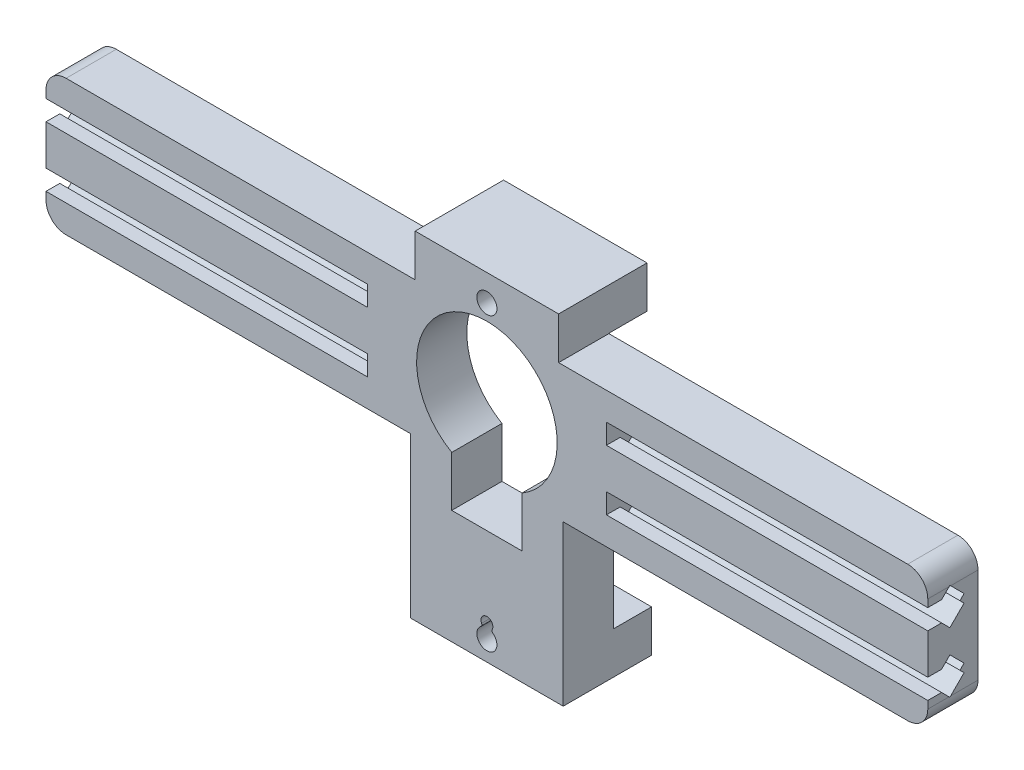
ISO-10303-21;
HEADER;
FILE_DESCRIPTION(('STEP AP214'),'2;1');
FILE_NAME('part.step','',(''),(''),'','','');
FILE_SCHEMA(('AUTOMOTIVE_DESIGN { 1 0 10303 214 1 1 1 1 }'));
ENDSEC;
DATA;
#1=APPLICATION_CONTEXT('core data for automotive mechanical design processes');
#2=APPLICATION_PROTOCOL_DEFINITION('international standard','automotive_design',2000,#1);
#3=PRODUCT_CONTEXT('',#1,'mechanical');
#4=PRODUCT('Part','Part','',(#3));
#5=PRODUCT_RELATED_PRODUCT_CATEGORY('part','',(#4));
#6=PRODUCT_DEFINITION_FORMATION('','',#4);
#7=PRODUCT_DEFINITION_CONTEXT('part definition',#1,'design');
#8=PRODUCT_DEFINITION('design','',#6,#7);
#9=PRODUCT_DEFINITION_SHAPE('','',#8);
#10=(LENGTH_UNIT() NAMED_UNIT(*) SI_UNIT(.MILLI.,.METRE.));
#11=(NAMED_UNIT(*) PLANE_ANGLE_UNIT() SI_UNIT($,.RADIAN.));
#12=(NAMED_UNIT(*) SI_UNIT($,.STERADIAN.) SOLID_ANGLE_UNIT());
#13=UNCERTAINTY_MEASURE_WITH_UNIT(LENGTH_MEASURE(1.E-05),#10,'distance_accuracy_value','');
#14=(GEOMETRIC_REPRESENTATION_CONTEXT(3) GLOBAL_UNCERTAINTY_ASSIGNED_CONTEXT((#13)) GLOBAL_UNIT_ASSIGNED_CONTEXT((#10,
#11,#12)) REPRESENTATION_CONTEXT('',''));
#15=CARTESIAN_POINT('',(0.,0.,0.));
#16=DIRECTION('',(0.,0.,1.));
#17=DIRECTION('',(1.,0.,0.));
#18=AXIS2_PLACEMENT_3D('',#15,#16,#17);
#19=CARTESIAN_POINT('',(41.9,-4.5,4.));
#20=DIRECTION('',(0.,0.,-1.));
#21=DIRECTION('',(-1.,0.,0.));
#22=AXIS2_PLACEMENT_3D('',#19,#20,#21);
#23=CYLINDRICAL_SURFACE('',#22,2.);
#24=DIRECTION('',(0.,0.,-1.));
#25=VECTOR('',#24,1.);
#26=CARTESIAN_POINT('',(41.9,-6.5,4.));
#27=LINE('',#26,#25);
#28=CARTESIAN_POINT('',(41.9,-6.5,-1.));
#29=VERTEX_POINT('',#28);
#30=CARTESIAN_POINT('',(41.9,-6.5,4.));
#31=VERTEX_POINT('',#30);
#32=EDGE_CURVE('E698',#29,#31,#27,.F.);
#33=ORIENTED_EDGE('',*,*,#32,.F.);
#34=CARTESIAN_POINT('',(41.9,-4.5,-1.));
#35=DIRECTION('',(0.,0.,-1.));
#36=DIRECTION('',(-1.,0.,0.));
#37=AXIS2_PLACEMENT_3D('',#34,#35,#36);
#38=CIRCLE('',#37,2.);
#39=CARTESIAN_POINT('',(43.9,-4.5,-1.));
#40=VERTEX_POINT('',#39);
#41=EDGE_CURVE('E1107',#40,#29,#38,.T.);
#42=ORIENTED_EDGE('',*,*,#41,.F.);
#43=DIRECTION('',(0.,0.,-1.));
#44=VECTOR('',#43,1.);
#45=CARTESIAN_POINT('',(43.9,-4.5,4.));
#46=LINE('',#45,#44);
#47=CARTESIAN_POINT('',(43.9,-4.5,1.72157287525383));
#48=VERTEX_POINT('',#47);
#49=EDGE_CURVE('E686',#48,#40,#46,.T.);
#50=ORIENTED_EDGE('',*,*,#49,.F.);
#51=CARTESIAN_POINT('',(41.9,-4.5,1.72157287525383));
#52=DIRECTION('',(0.,-0.707106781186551,-0.707106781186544));
#53=DIRECTION('',(0.,0.707106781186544,-0.707106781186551));
#54=AXIS2_PLACEMENT_3D('',#51,#52,#53);
#55=ELLIPSE('',#54,2.82842712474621,2.);
#56=CARTESIAN_POINT('',(43.8984617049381,-4.57842712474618,1.80000000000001));
#57=VERTEX_POINT('',#56);
#58=EDGE_CURVE('E704',#57,#48,#55,.F.);
#59=ORIENTED_EDGE('',*,*,#58,.F.);
#60=CARTESIAN_POINT('',(41.9,-4.5,1.87842712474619));
#61=DIRECTION('',(0.,0.70710678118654,-0.707106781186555));
#62=DIRECTION('',(0.,-0.707106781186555,-0.70710678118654));
#63=AXIS2_PLACEMENT_3D('',#60,#61,#62);
#64=ELLIPSE('',#63,2.82842712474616,2.);
#65=CARTESIAN_POINT('',(43.9,-4.5,1.87842712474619));
#66=VERTEX_POINT('',#65);
#67=EDGE_CURVE('E706',#57,#66,#64,.F.);
#68=ORIENTED_EDGE('',*,*,#67,.T.);
#69=CARTESIAN_POINT('',(43.9,-4.5,4.));
#70=VERTEX_POINT('',#69);
#71=EDGE_CURVE('E687',#70,#66,#46,.T.);
#72=ORIENTED_EDGE('',*,*,#71,.F.);
#73=CARTESIAN_POINT('',(41.9,-4.5,4.));
#74=DIRECTION('',(0.,0.,1.));
#75=DIRECTION('',(1.,0.,0.));
#76=AXIS2_PLACEMENT_3D('',#73,#74,#75);
#77=CIRCLE('',#76,2.);
#78=EDGE_CURVE('E667',#31,#70,#77,.T.);
#79=ORIENTED_EDGE('',*,*,#78,.F.);
#80=EDGE_LOOP('',(#33,#42,#50,#59,#68,#72,#79));
#81=FACE_BOUND('',#80,.T.);
#82=ADVANCED_FACE('F143',(#81),#23,.T.);
#83=CARTESIAN_POINT('',(-43.9,7.,4.));
#84=DIRECTION('',(1.,0.,0.));
#85=DIRECTION('',(0.,0.,-1.));
#86=AXIS2_PLACEMENT_3D('',#83,#84,#85);
#87=PLANE('',#86);
#88=DIRECTION('',(0.,-1.,0.));
#89=VECTOR('',#88,1.);
#90=CARTESIAN_POINT('',(-43.9,0.,-1.));
#91=LINE('',#90,#89);
#92=CARTESIAN_POINT('',(-43.9,5.,-1.));
#93=VERTEX_POINT('',#92);
#94=CARTESIAN_POINT('',(-43.9,-4.5,-1.));
#95=VERTEX_POINT('',#94);
#96=EDGE_CURVE('E1087',#93,#95,#91,.T.);
#97=ORIENTED_EDGE('',*,*,#96,.T.);
#98=DIRECTION('',(0.,0.,-1.));
#99=VECTOR('',#98,1.);
#100=CARTESIAN_POINT('',(-43.9,-4.5,4.));
#101=LINE('',#100,#99);
#102=CARTESIAN_POINT('',(-43.9,-4.5,1.72157287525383));
#103=VERTEX_POINT('',#102);
#104=EDGE_CURVE('E665',#95,#103,#101,.F.);
#105=ORIENTED_EDGE('',*,*,#104,.T.);
#106=DIRECTION('',(0.,-0.707106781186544,0.707106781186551));
#107=VECTOR('',#106,1.);
#108=CARTESIAN_POINT('',(-43.9,-1.38921356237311,-1.3892135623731));
#109=LINE('',#108,#107);
#110=CARTESIAN_POINT('',(-43.9,-3.1642135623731,0.385786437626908));
#111=VERTEX_POINT('',#110);
#112=EDGE_CURVE('E941',#111,#103,#109,.T.);
#113=ORIENTED_EDGE('',*,*,#112,.F.);
#114=DIRECTION('',(0.,-0.707106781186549,-0.707106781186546));
#115=VECTOR('',#114,1.);
#116=CARTESIAN_POINT('',(-43.9,-1.775,1.775));
#117=LINE('',#116,#115);
#118=CARTESIAN_POINT('',(-43.9,-2.75,0.800000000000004));
#119=VERTEX_POINT('',#118);
#120=EDGE_CURVE('E939',#119,#111,#117,.T.);
#121=ORIENTED_EDGE('',*,*,#120,.F.);
#122=DIRECTION('',(0.,0.707106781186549,-0.707106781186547));
#123=VECTOR('',#122,1.);
#124=CARTESIAN_POINT('',(-43.9,-0.974999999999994,-0.974999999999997));
#125=LINE('',#124,#123);
#126=CARTESIAN_POINT('',(-43.9,-2.3357864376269,0.385786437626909));
#127=VERTEX_POINT('',#126);
#128=EDGE_CURVE('E836',#119,#127,#125,.T.);
#129=ORIENTED_EDGE('',*,*,#128,.T.);
#130=DIRECTION('',(0.,0.707106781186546,0.707106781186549));
#131=VECTOR('',#130,1.);
#132=CARTESIAN_POINT('',(-43.9,-1.36078643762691,1.3607864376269));
#133=LINE('',#132,#131);
#134=CARTESIAN_POINT('',(-43.9,-0.921572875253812,1.80000000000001));
#135=VERTEX_POINT('',#134);
#136=EDGE_CURVE('E833',#127,#135,#133,.T.);
#137=ORIENTED_EDGE('',*,*,#136,.T.);
#138=DIRECTION('',(0.,-0.707106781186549,0.707106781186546));
#139=VECTOR('',#138,1.);
#140=CARTESIAN_POINT('',(-43.9,0.439213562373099,0.439213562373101));
#141=LINE('',#140,#139);
#142=CARTESIAN_POINT('',(-43.9,-1.75,2.62842712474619));
#143=VERTEX_POINT('',#142);
#144=EDGE_CURVE('E780',#135,#143,#141,.T.);
#145=ORIENTED_EDGE('',*,*,#144,.T.);
#146=DIRECTION('',(0.,0.,1.));
#147=VECTOR('',#146,1.);
#148=CARTESIAN_POINT('',(-43.9,-1.75,0.));
#149=LINE('',#148,#147);
#150=CARTESIAN_POINT('',(-43.9,-1.75,4.));
#151=VERTEX_POINT('',#150);
#152=EDGE_CURVE('E875',#143,#151,#149,.T.);
#153=ORIENTED_EDGE('',*,*,#152,.T.);
#154=DIRECTION('',(0.,-1.,0.));
#155=VECTOR('',#154,1.);
#156=CARTESIAN_POINT('',(-43.9,7.,4.));
#157=LINE('',#156,#155);
#158=CARTESIAN_POINT('',(-43.9,2.25,4.));
#159=VERTEX_POINT('',#158);
#160=EDGE_CURVE('E614',#159,#151,#157,.T.);
#161=ORIENTED_EDGE('',*,*,#160,.F.);
#162=DIRECTION('',(0.,0.,-1.));
#163=VECTOR('',#162,1.);
#164=CARTESIAN_POINT('',(-43.9,2.25,0.));
#165=LINE('',#164,#163);
#166=CARTESIAN_POINT('',(-43.9,2.25,2.62842712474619));
#167=VERTEX_POINT('',#166);
#168=EDGE_CURVE('E880',#159,#167,#165,.T.);
#169=ORIENTED_EDGE('',*,*,#168,.T.);
#170=DIRECTION('',(0.,0.707106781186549,0.707106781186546));
#171=VECTOR('',#170,1.);
#172=CARTESIAN_POINT('',(-43.9,-0.189213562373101,0.189213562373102));
#173=LINE('',#172,#171);
#174=CARTESIAN_POINT('',(-43.9,1.42157287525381,1.80000000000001));
#175=VERTEX_POINT('',#174);
#176=EDGE_CURVE('E902',#175,#167,#173,.T.);
#177=ORIENTED_EDGE('',*,*,#176,.F.);
#178=DIRECTION('',(0.,-0.707106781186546,0.707106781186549));
#179=VECTOR('',#178,1.);
#180=CARTESIAN_POINT('',(-43.9,1.61078643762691,1.6107864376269));
#181=LINE('',#180,#179);
#182=CARTESIAN_POINT('',(-43.9,2.8357864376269,0.385786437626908));
#183=VERTEX_POINT('',#182);
#184=EDGE_CURVE('E899',#183,#175,#181,.T.);
#185=ORIENTED_EDGE('',*,*,#184,.F.);
#186=DIRECTION('',(0.,-0.707106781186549,-0.707106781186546));
#187=VECTOR('',#186,1.);
#188=CARTESIAN_POINT('',(-43.9,1.22499999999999,-1.225));
#189=LINE('',#188,#187);
#190=CARTESIAN_POINT('',(-43.9,3.25,0.800000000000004));
#191=VERTEX_POINT('',#190);
#192=EDGE_CURVE('E896',#191,#183,#189,.T.);
#193=ORIENTED_EDGE('',*,*,#192,.F.);
#194=DIRECTION('',(0.,0.707106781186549,-0.707106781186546));
#195=VECTOR('',#194,1.);
#196=CARTESIAN_POINT('',(-43.9,2.025,2.025));
#197=LINE('',#196,#195);
#198=CARTESIAN_POINT('',(-43.9,3.6642135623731,0.385786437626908));
#199=VERTEX_POINT('',#198);
#200=EDGE_CURVE('E817',#191,#199,#197,.T.);
#201=ORIENTED_EDGE('',*,*,#200,.T.);
#202=DIRECTION('',(0.,0.707106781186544,0.707106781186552));
#203=VECTOR('',#202,1.);
#204=CARTESIAN_POINT('',(-43.9,1.63921356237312,-1.6392135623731));
#205=LINE('',#204,#203);
#206=CARTESIAN_POINT('',(-43.9,5.,1.72157287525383));
#207=VERTEX_POINT('',#206);
#208=EDGE_CURVE('E814',#199,#207,#205,.T.);
#209=ORIENTED_EDGE('',*,*,#208,.T.);
#210=DIRECTION('',(0.,0.,-1.));
#211=VECTOR('',#210,1.);
#212=CARTESIAN_POINT('',(-43.9,5.,4.));
#213=LINE('',#212,#211);
#214=EDGE_CURVE('E658',#207,#93,#213,.T.);
#215=ORIENTED_EDGE('',*,*,#214,.T.);
#216=EDGE_LOOP('',(#97,#105,#113,#121,#129,#137,#145,#153,#161,#169,#177,#185,#193,#201,#209,#215));
#217=FACE_BOUND('',#216,.T.);
#218=ADVANCED_FACE('F1177',(#217),#87,.F.);
#219=CARTESIAN_POINT('',(43.9,7.,4.));
#220=DIRECTION('',(-1.,0.,0.));
#221=DIRECTION('',(0.,0.,1.));
#222=AXIS2_PLACEMENT_3D('',#219,#220,#221);
#223=PLANE('',#222);
#224=DIRECTION('',(0.,1.,0.));
#225=VECTOR('',#224,1.);
#226=CARTESIAN_POINT('',(43.9,0.,-1.));
#227=LINE('',#226,#225);
#228=CARTESIAN_POINT('',(43.9,5.,-1.));
#229=VERTEX_POINT('',#228);
#230=EDGE_CURVE('E1109',#40,#229,#227,.T.);
#231=ORIENTED_EDGE('',*,*,#230,.T.);
#232=DIRECTION('',(0.,0.,-1.));
#233=VECTOR('',#232,1.);
#234=CARTESIAN_POINT('',(43.9,5.,4.));
#235=LINE('',#234,#233);
#236=CARTESIAN_POINT('',(43.9,5.,1.72157287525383));
#237=VERTEX_POINT('',#236);
#238=EDGE_CURVE('E692',#229,#237,#235,.F.);
#239=ORIENTED_EDGE('',*,*,#238,.T.);
#240=DIRECTION('',(0.,0.707106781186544,0.707106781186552));
#241=VECTOR('',#240,1.);
#242=CARTESIAN_POINT('',(43.9,3.6642135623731,0.385786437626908));
#243=LINE('',#242,#241);
#244=CARTESIAN_POINT('',(43.9,3.6642135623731,0.385786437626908));
#245=VERTEX_POINT('',#244);
#246=EDGE_CURVE('E1039',#245,#237,#243,.T.);
#247=ORIENTED_EDGE('',*,*,#246,.F.);
#248=DIRECTION('',(0.,0.707106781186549,-0.707106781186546));
#249=VECTOR('',#248,1.);
#250=CARTESIAN_POINT('',(43.9,2.25,1.8));
#251=LINE('',#250,#249);
#252=CARTESIAN_POINT('',(43.9,3.25,0.800000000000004));
#253=VERTEX_POINT('',#252);
#254=EDGE_CURVE('E1037',#253,#245,#251,.T.);
#255=ORIENTED_EDGE('',*,*,#254,.F.);
#256=DIRECTION('',(0.,0.707106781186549,0.707106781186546));
#257=VECTOR('',#256,1.);
#258=CARTESIAN_POINT('',(43.9,6.725,4.275));
#259=LINE('',#258,#257);
#260=CARTESIAN_POINT('',(43.9,2.8357864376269,0.385786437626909));
#261=VERTEX_POINT('',#260);
#262=EDGE_CURVE('E763',#261,#253,#259,.T.);
#263=ORIENTED_EDGE('',*,*,#262,.F.);
#264=DIRECTION('',(0.,0.707106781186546,-0.707106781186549));
#265=VECTOR('',#264,1.);
#266=CARTESIAN_POINT('',(43.9,3.11078643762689,0.110786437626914));
#267=LINE('',#266,#265);
#268=CARTESIAN_POINT('',(43.9,1.42157287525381,1.80000000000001));
#269=VERTEX_POINT('',#268);
#270=EDGE_CURVE('E759',#269,#261,#267,.T.);
#271=ORIENTED_EDGE('',*,*,#270,.F.);
#272=DIRECTION('',(0.,-0.707106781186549,-0.707106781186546));
#273=VECTOR('',#272,1.);
#274=CARTESIAN_POINT('',(43.9,5.31078643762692,5.68921356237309));
#275=LINE('',#274,#273);
#276=CARTESIAN_POINT('',(43.9,2.25,2.62842712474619));
#277=VERTEX_POINT('',#276);
#278=EDGE_CURVE('E756',#277,#269,#275,.T.);
#279=ORIENTED_EDGE('',*,*,#278,.F.);
#280=DIRECTION('',(0.,0.,-1.));
#281=VECTOR('',#280,1.);
#282=CARTESIAN_POINT('',(43.9,2.25,4.));
#283=LINE('',#282,#281);
#284=CARTESIAN_POINT('',(43.9,2.25,4.));
#285=VERTEX_POINT('',#284);
#286=EDGE_CURVE('E1008',#285,#277,#283,.T.);
#287=ORIENTED_EDGE('',*,*,#286,.F.);
#288=DIRECTION('',(0.,1.,0.));
#289=VECTOR('',#288,1.);
#290=CARTESIAN_POINT('',(43.9,7.,4.));
#291=LINE('',#290,#289);
#292=CARTESIAN_POINT('',(43.9,-1.75,4.));
#293=VERTEX_POINT('',#292);
#294=EDGE_CURVE('E629',#293,#285,#291,.T.);
#295=ORIENTED_EDGE('',*,*,#294,.F.);
#296=DIRECTION('',(0.,0.,1.));
#297=VECTOR('',#296,1.);
#298=CARTESIAN_POINT('',(43.9,-1.75,4.));
#299=LINE('',#298,#297);
#300=CARTESIAN_POINT('',(43.9,-1.75,2.62842712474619));
#301=VERTEX_POINT('',#300);
#302=EDGE_CURVE('E979',#301,#293,#299,.T.);
#303=ORIENTED_EDGE('',*,*,#302,.F.);
#304=DIRECTION('',(0.,-0.707106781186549,0.707106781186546));
#305=VECTOR('',#304,1.);
#306=CARTESIAN_POINT('',(43.9,-0.92157287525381,1.80000000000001));
#307=LINE('',#306,#305);
#308=CARTESIAN_POINT('',(43.9,-0.92157287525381,1.80000000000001));
#309=VERTEX_POINT('',#308);
#310=EDGE_CURVE('E1001',#309,#301,#307,.T.);
#311=ORIENTED_EDGE('',*,*,#310,.F.);
#312=DIRECTION('',(0.,0.707106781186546,0.707106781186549));
#313=VECTOR('',#312,1.);
#314=CARTESIAN_POINT('',(43.9,-2.3357864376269,0.385786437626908));
#315=LINE('',#314,#313);
#316=CARTESIAN_POINT('',(43.9,-2.3357864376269,0.385786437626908));
#317=VERTEX_POINT('',#316);
#318=EDGE_CURVE('E998',#317,#309,#315,.T.);
#319=ORIENTED_EDGE('',*,*,#318,.F.);
#320=DIRECTION('',(0.,0.707106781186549,-0.707106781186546));
#321=VECTOR('',#320,1.);
#322=CARTESIAN_POINT('',(43.9,-3.75,1.8));
#323=LINE('',#322,#321);
#324=CARTESIAN_POINT('',(43.9,-2.75,0.800000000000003));
#325=VERTEX_POINT('',#324);
#326=EDGE_CURVE('E996',#325,#317,#323,.T.);
#327=ORIENTED_EDGE('',*,*,#326,.F.);
#328=DIRECTION('',(0.,0.707106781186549,0.707106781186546));
#329=VECTOR('',#328,1.);
#330=CARTESIAN_POINT('',(43.9,3.72500000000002,7.275));
#331=LINE('',#330,#329);
#332=CARTESIAN_POINT('',(43.9,-3.1642135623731,0.385786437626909));
#333=VERTEX_POINT('',#332);
#334=EDGE_CURVE('E784',#333,#325,#331,.T.);
#335=ORIENTED_EDGE('',*,*,#334,.F.);
#336=DIRECTION('',(0.,0.707106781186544,-0.707106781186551));
#337=VECTOR('',#336,1.);
#338=CARTESIAN_POINT('',(43.9,0.110786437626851,-2.88921356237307));
#339=LINE('',#338,#337);
#340=EDGE_CURVE('E787',#48,#333,#339,.T.);
#341=ORIENTED_EDGE('',*,*,#340,.F.);
#342=ORIENTED_EDGE('',*,*,#49,.T.);
#343=EDGE_LOOP('',(#231,#239,#247,#255,#263,#271,#279,#287,#295,#303,#311,#319,#327,#335,#341,#342));
#344=FACE_BOUND('',#343,.T.);
#345=ADVANCED_FACE('F1138',(#344),#223,.F.);
#346=CARTESIAN_POINT('',(7.14142842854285,7.,4.));
#347=DIRECTION('',(-1.,0.,0.));
#348=DIRECTION('',(0.,0.,1.));
#349=AXIS2_PLACEMENT_3D('',#346,#347,#348);
#350=PLANE('',#349);
#351=DIRECTION('',(0.,1.,0.));
#352=VECTOR('',#351,1.);
#353=CARTESIAN_POINT('',(7.14142842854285,0.,-1.));
#354=LINE('',#353,#352);
#355=CARTESIAN_POINT('',(7.14142842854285,7.,-1.));
#356=VERTEX_POINT('',#355);
#357=CARTESIAN_POINT('',(7.14142842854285,7.03,-1.));
#358=VERTEX_POINT('',#357);
#359=EDGE_CURVE('E748',#356,#358,#354,.T.);
#360=ORIENTED_EDGE('',*,*,#359,.T.);
#361=DIRECTION('',(0.,0.,1.));
#362=VECTOR('',#361,1.);
#363=CARTESIAN_POINT('',(7.14142842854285,7.03,-6.8));
#364=LINE('',#363,#362);
#365=CARTESIAN_POINT('',(7.14142842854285,7.03,-4.8));
#366=VERTEX_POINT('',#365);
#367=EDGE_CURVE('E965',#366,#358,#364,.T.);
#368=ORIENTED_EDGE('',*,*,#367,.F.);
#369=DIRECTION('',(0.,1.,0.));
#370=VECTOR('',#369,1.);
#371=CARTESIAN_POINT('',(7.14142842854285,0.,-4.8));
#372=LINE('',#371,#370);
#373=CARTESIAN_POINT('',(7.14142842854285,11.2,-4.8));
#374=VERTEX_POINT('',#373);
#375=EDGE_CURVE('E852',#366,#374,#372,.T.);
#376=ORIENTED_EDGE('',*,*,#375,.T.);
#377=DIRECTION('',(0.,0.,-1.));
#378=VECTOR('',#377,1.);
#379=CARTESIAN_POINT('',(7.14142842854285,11.2,4.));
#380=LINE('',#379,#378);
#381=CARTESIAN_POINT('',(7.14142842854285,11.2,4.));
#382=VERTEX_POINT('',#381);
#383=EDGE_CURVE('E652',#382,#374,#380,.T.);
#384=ORIENTED_EDGE('',*,*,#383,.F.);
#385=DIRECTION('',(0.,1.,0.));
#386=VECTOR('',#385,1.);
#387=CARTESIAN_POINT('',(7.14142842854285,7.,4.));
#388=LINE('',#387,#386);
#389=CARTESIAN_POINT('',(7.14142842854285,7.,4.));
#390=VERTEX_POINT('',#389);
#391=EDGE_CURVE('E599',#390,#382,#388,.T.);
#392=ORIENTED_EDGE('',*,*,#391,.F.);
#393=DIRECTION('',(0.,0.,-1.));
#394=VECTOR('',#393,1.);
#395=CARTESIAN_POINT('',(7.14142842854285,7.,4.));
#396=LINE('',#395,#394);
#397=EDGE_CURVE('E631',#390,#356,#396,.T.);
#398=ORIENTED_EDGE('',*,*,#397,.T.);
#399=EDGE_LOOP('',(#360,#368,#376,#384,#392,#398));
#400=FACE_BOUND('',#399,.T.);
#401=ADVANCED_FACE('F1123',(#400),#350,.F.);
#402=CARTESIAN_POINT('',(-7.14142842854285,7.,4.));
#403=DIRECTION('',(1.,0.,0.));
#404=DIRECTION('',(0.,0.,-1.));
#405=AXIS2_PLACEMENT_3D('',#402,#403,#404);
#406=PLANE('',#405);
#407=DIRECTION('',(0.,0.,1.));
#408=VECTOR('',#407,1.);
#409=CARTESIAN_POINT('',(-7.14142842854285,7.03,-6.8));
#410=LINE('',#409,#408);
#411=CARTESIAN_POINT('',(-7.14142842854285,7.03,-4.8));
#412=VERTEX_POINT('',#411);
#413=CARTESIAN_POINT('',(-7.14142842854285,7.03,-1.));
#414=VERTEX_POINT('',#413);
#415=EDGE_CURVE('E963',#412,#414,#410,.T.);
#416=ORIENTED_EDGE('',*,*,#415,.T.);
#417=DIRECTION('',(0.,-1.,0.));
#418=VECTOR('',#417,1.);
#419=CARTESIAN_POINT('',(-7.14142842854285,0.,-1.));
#420=LINE('',#419,#418);
#421=CARTESIAN_POINT('',(-7.14142842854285,7.,-1.));
#422=VERTEX_POINT('',#421);
#423=EDGE_CURVE('E1076',#414,#422,#420,.T.);
#424=ORIENTED_EDGE('',*,*,#423,.T.);
#425=DIRECTION('',(0.,0.,-1.));
#426=VECTOR('',#425,1.);
#427=CARTESIAN_POINT('',(-7.14142842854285,7.,4.));
#428=LINE('',#427,#426);
#429=CARTESIAN_POINT('',(-7.14142842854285,7.,4.));
#430=VERTEX_POINT('',#429);
#431=EDGE_CURVE('E646',#430,#422,#428,.T.);
#432=ORIENTED_EDGE('',*,*,#431,.F.);
#433=DIRECTION('',(0.,-1.,0.));
#434=VECTOR('',#433,1.);
#435=CARTESIAN_POINT('',(-7.14142842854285,7.,4.));
#436=LINE('',#435,#434);
#437=CARTESIAN_POINT('',(-7.14142842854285,11.2,4.));
#438=VERTEX_POINT('',#437);
#439=EDGE_CURVE('E604',#438,#430,#436,.T.);
#440=ORIENTED_EDGE('',*,*,#439,.F.);
#441=DIRECTION('',(0.,0.,-1.));
#442=VECTOR('',#441,1.);
#443=CARTESIAN_POINT('',(-7.14142842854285,11.2,4.));
#444=LINE('',#443,#442);
#445=CARTESIAN_POINT('',(-7.14142842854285,11.2,-4.8));
#446=VERTEX_POINT('',#445);
#447=EDGE_CURVE('E649',#438,#446,#444,.T.);
#448=ORIENTED_EDGE('',*,*,#447,.T.);
#449=DIRECTION('',(0.,-1.,0.));
#450=VECTOR('',#449,1.);
#451=CARTESIAN_POINT('',(-7.14142842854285,0.,-4.8));
#452=LINE('',#451,#450);
#453=EDGE_CURVE('E866',#446,#412,#452,.T.);
#454=ORIENTED_EDGE('',*,*,#453,.T.);
#455=EDGE_LOOP('',(#416,#424,#432,#440,#448,#454));
#456=FACE_BOUND('',#455,.T.);
#457=ADVANCED_FACE('F1428',(#456),#406,.F.);
#458=CARTESIAN_POINT('',(-7.14142842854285,7.,4.));
#459=DIRECTION('',(0.,-1.,0.));
#460=DIRECTION('',(1.,0.,0.));
#461=AXIS2_PLACEMENT_3D('',#458,#459,#460);
#462=PLANE('',#461);
#463=DIRECTION('',(-1.,0.,0.));
#464=VECTOR('',#463,1.);
#465=CARTESIAN_POINT('',(0.,7.,-1.));
#466=LINE('',#465,#464);
#467=CARTESIAN_POINT('',(-41.9,7.,-1.));
#468=VERTEX_POINT('',#467);
#469=EDGE_CURVE('E1082',#422,#468,#466,.T.);
#470=ORIENTED_EDGE('',*,*,#469,.T.);
#471=DIRECTION('',(0.,0.,-1.));
#472=VECTOR('',#471,1.);
#473=CARTESIAN_POINT('',(-41.9,7.,4.));
#474=LINE('',#473,#472);
#475=CARTESIAN_POINT('',(-41.9,7.,4.));
#476=VERTEX_POINT('',#475);
#477=EDGE_CURVE('E681',#468,#476,#474,.F.);
#478=ORIENTED_EDGE('',*,*,#477,.T.);
#479=DIRECTION('',(-1.,0.,0.));
#480=VECTOR('',#479,1.);
#481=CARTESIAN_POINT('',(-7.14142842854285,7.,4.));
#482=LINE('',#481,#480);
#483=EDGE_CURVE('E606',#430,#476,#482,.T.);
#484=ORIENTED_EDGE('',*,*,#483,.F.);
#485=ORIENTED_EDGE('',*,*,#431,.T.);
#486=EDGE_LOOP('',(#470,#478,#484,#485));
#487=FACE_BOUND('',#486,.T.);
#488=ADVANCED_FACE('F1424',(#487),#462,.F.);
#489=CARTESIAN_POINT('',(-43.9,-6.5,4.));
#490=DIRECTION('',(0.,1.,0.));
#491=DIRECTION('',(0.,0.,1.));
#492=AXIS2_PLACEMENT_3D('',#489,#490,#491);
#493=PLANE('',#492);
#494=DIRECTION('',(1.,0.,0.));
#495=VECTOR('',#494,1.);
#496=CARTESIAN_POINT('',(0.,-6.5,-1.));
#497=LINE('',#496,#495);
#498=CARTESIAN_POINT('',(-41.9,-6.5,-1.));
#499=VERTEX_POINT('',#498);
#500=CARTESIAN_POINT('',(-7.59934207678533,-6.5,-1.));
#501=VERTEX_POINT('',#500);
#502=EDGE_CURVE('E1092',#499,#501,#497,.T.);
#503=ORIENTED_EDGE('',*,*,#502,.T.);
#504=DIRECTION('',(0.,0.,-1.));
#505=VECTOR('',#504,1.);
#506=CARTESIAN_POINT('',(-7.59934207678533,-6.5,4.));
#507=LINE('',#506,#505);
#508=CARTESIAN_POINT('',(-7.59934207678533,-6.5,4.));
#509=VERTEX_POINT('',#508);
#510=EDGE_CURVE('E643',#509,#501,#507,.T.);
#511=ORIENTED_EDGE('',*,*,#510,.F.);
#512=DIRECTION('',(1.,0.,0.));
#513=VECTOR('',#512,1.);
#514=CARTESIAN_POINT('',(-43.9,-6.5,4.));
#515=LINE('',#514,#513);
#516=CARTESIAN_POINT('',(-41.9,-6.5,4.));
#517=VERTEX_POINT('',#516);
#518=EDGE_CURVE('E613',#517,#509,#515,.T.);
#519=ORIENTED_EDGE('',*,*,#518,.F.);
#520=DIRECTION('',(0.,0.,-1.));
#521=VECTOR('',#520,1.);
#522=CARTESIAN_POINT('',(-41.9,-6.5,4.));
#523=LINE('',#522,#521);
#524=EDGE_CURVE('E655',#517,#499,#523,.T.);
#525=ORIENTED_EDGE('',*,*,#524,.T.);
#526=EDGE_LOOP('',(#503,#511,#519,#525));
#527=FACE_BOUND('',#526,.T.);
#528=ADVANCED_FACE('F1166',(#527),#493,.F.);
#529=CARTESIAN_POINT('',(-7.59934207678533,-6.5,4.));
#530=DIRECTION('',(1.,0.,0.));
#531=DIRECTION('',(0.,1.,0.));
#532=AXIS2_PLACEMENT_3D('',#529,#530,#531);
#533=PLANE('',#532);
#534=DIRECTION('',(0.,-1.,0.));
#535=VECTOR('',#534,1.);
#536=CARTESIAN_POINT('',(-7.59934207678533,0.,-1.));
#537=LINE('',#536,#535);
#538=CARTESIAN_POINT('',(-7.59934207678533,-18.23,-1.));
#539=VERTEX_POINT('',#538);
#540=EDGE_CURVE('E1095',#501,#539,#537,.T.);
#541=ORIENTED_EDGE('',*,*,#540,.T.);
#542=DIRECTION('',(0.,0.,1.));
#543=VECTOR('',#542,1.);
#544=CARTESIAN_POINT('',(-7.59934207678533,-18.23,-6.8));
#545=LINE('',#544,#543);
#546=CARTESIAN_POINT('',(-7.59934207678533,-18.23,-4.8));
#547=VERTEX_POINT('',#546);
#548=EDGE_CURVE('E961',#547,#539,#545,.T.);
#549=ORIENTED_EDGE('',*,*,#548,.F.);
#550=DIRECTION('',(0.,-1.,0.));
#551=VECTOR('',#550,1.);
#552=CARTESIAN_POINT('',(-7.59934207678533,0.,-4.8));
#553=LINE('',#552,#551);
#554=CARTESIAN_POINT('',(-7.59934207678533,-22.4,-4.8));
#555=VERTEX_POINT('',#554);
#556=EDGE_CURVE('E736',#547,#555,#553,.T.);
#557=ORIENTED_EDGE('',*,*,#556,.T.);
#558=DIRECTION('',(0.,0.,-1.));
#559=VECTOR('',#558,1.);
#560=CARTESIAN_POINT('',(-7.59934207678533,-22.4,4.));
#561=LINE('',#560,#559);
#562=CARTESIAN_POINT('',(-7.59934207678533,-22.4,4.));
#563=VERTEX_POINT('',#562);
#564=EDGE_CURVE('E640',#563,#555,#561,.T.);
#565=ORIENTED_EDGE('',*,*,#564,.F.);
#566=DIRECTION('',(0.,-1.,0.));
#567=VECTOR('',#566,1.);
#568=CARTESIAN_POINT('',(-7.59934207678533,-6.5,4.));
#569=LINE('',#568,#567);
#570=EDGE_CURVE('E616',#509,#563,#569,.T.);
#571=ORIENTED_EDGE('',*,*,#570,.F.);
#572=ORIENTED_EDGE('',*,*,#510,.T.);
#573=EDGE_LOOP('',(#541,#549,#557,#565,#571,#572));
#574=FACE_BOUND('',#573,.T.);
#575=ADVANCED_FACE('F1160',(#574),#533,.F.);
#576=CARTESIAN_POINT('',(7.59934207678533,-6.5,4.));
#577=DIRECTION('',(-1.,0.,0.));
#578=DIRECTION('',(0.,-1.,0.));
#579=AXIS2_PLACEMENT_3D('',#576,#577,#578);
#580=PLANE('',#579);
#581=DIRECTION('',(0.,0.,1.));
#582=VECTOR('',#581,1.);
#583=CARTESIAN_POINT('',(7.59934207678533,-18.23,-6.8));
#584=LINE('',#583,#582);
#585=CARTESIAN_POINT('',(7.59934207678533,-18.23,-4.8));
#586=VERTEX_POINT('',#585);
#587=CARTESIAN_POINT('',(7.59934207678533,-18.23,-1.));
#588=VERTEX_POINT('',#587);
#589=EDGE_CURVE('E910',#586,#588,#584,.T.);
#590=ORIENTED_EDGE('',*,*,#589,.T.);
#591=DIRECTION('',(0.,1.,0.));
#592=VECTOR('',#591,1.);
#593=CARTESIAN_POINT('',(7.59934207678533,0.,-1.));
#594=LINE('',#593,#592);
#595=CARTESIAN_POINT('',(7.59934207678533,-6.5,-1.));
#596=VERTEX_POINT('',#595);
#597=EDGE_CURVE('E1101',#588,#596,#594,.T.);
#598=ORIENTED_EDGE('',*,*,#597,.T.);
#599=DIRECTION('',(0.,0.,-1.));
#600=VECTOR('',#599,1.);
#601=CARTESIAN_POINT('',(7.59934207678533,-6.5,4.));
#602=LINE('',#601,#600);
#603=CARTESIAN_POINT('',(7.59934207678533,-6.5,4.));
#604=VERTEX_POINT('',#603);
#605=EDGE_CURVE('E634',#604,#596,#602,.T.);
#606=ORIENTED_EDGE('',*,*,#605,.F.);
#607=DIRECTION('',(0.,1.,0.));
#608=VECTOR('',#607,1.);
#609=CARTESIAN_POINT('',(7.59934207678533,-6.5,4.));
#610=LINE('',#609,#608);
#611=CARTESIAN_POINT('',(7.59934207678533,-22.4,4.));
#612=VERTEX_POINT('',#611);
#613=EDGE_CURVE('E620',#612,#604,#610,.T.);
#614=ORIENTED_EDGE('',*,*,#613,.F.);
#615=DIRECTION('',(0.,0.,-1.));
#616=VECTOR('',#615,1.);
#617=CARTESIAN_POINT('',(7.59934207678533,-22.4,4.));
#618=LINE('',#617,#616);
#619=CARTESIAN_POINT('',(7.59934207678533,-22.4,-4.8));
#620=VERTEX_POINT('',#619);
#621=EDGE_CURVE('E637',#612,#620,#618,.T.);
#622=ORIENTED_EDGE('',*,*,#621,.T.);
#623=DIRECTION('',(0.,1.,0.));
#624=VECTOR('',#623,1.);
#625=CARTESIAN_POINT('',(7.59934207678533,0.,-4.8));
#626=LINE('',#625,#624);
#627=EDGE_CURVE('E854',#620,#586,#626,.T.);
#628=ORIENTED_EDGE('',*,*,#627,.T.);
#629=EDGE_LOOP('',(#590,#598,#606,#614,#622,#628));
#630=FACE_BOUND('',#629,.T.);
#631=ADVANCED_FACE('F1154',(#630),#580,.F.);
#632=CARTESIAN_POINT('',(43.9,-6.5,4.));
#633=DIRECTION('',(0.,1.,0.));
#634=DIRECTION('',(0.,0.,1.));
#635=AXIS2_PLACEMENT_3D('',#632,#633,#634);
#636=PLANE('',#635);
#637=DIRECTION('',(1.,0.,0.));
#638=VECTOR('',#637,1.);
#639=CARTESIAN_POINT('',(0.,-6.5,-1.));
#640=LINE('',#639,#638);
#641=EDGE_CURVE('E1104',#596,#29,#640,.T.);
#642=ORIENTED_EDGE('',*,*,#641,.T.);
#643=ORIENTED_EDGE('',*,*,#32,.T.);
#644=DIRECTION('',(1.,0.,0.));
#645=VECTOR('',#644,1.);
#646=CARTESIAN_POINT('',(43.9,-6.5,4.));
#647=LINE('',#646,#645);
#648=EDGE_CURVE('E622',#604,#31,#647,.T.);
#649=ORIENTED_EDGE('',*,*,#648,.F.);
#650=ORIENTED_EDGE('',*,*,#605,.T.);
#651=EDGE_LOOP('',(#642,#643,#649,#650));
#652=FACE_BOUND('',#651,.T.);
#653=ADVANCED_FACE('F1149',(#652),#636,.F.);
#654=CARTESIAN_POINT('',(7.14142842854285,7.,4.));
#655=DIRECTION('',(0.,-1.,0.));
#656=DIRECTION('',(1.,0.,0.));
#657=AXIS2_PLACEMENT_3D('',#654,#655,#656);
#658=PLANE('',#657);
#659=DIRECTION('',(-1.,0.,0.));
#660=VECTOR('',#659,1.);
#661=CARTESIAN_POINT('',(0.,7.,-1.));
#662=LINE('',#661,#660);
#663=CARTESIAN_POINT('',(41.9,7.,-1.));
#664=VERTEX_POINT('',#663);
#665=EDGE_CURVE('E753',#664,#356,#662,.T.);
#666=ORIENTED_EDGE('',*,*,#665,.T.);
#667=ORIENTED_EDGE('',*,*,#397,.F.);
#668=DIRECTION('',(-1.,0.,0.));
#669=VECTOR('',#668,1.);
#670=CARTESIAN_POINT('',(7.14142842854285,7.,4.));
#671=LINE('',#670,#669);
#672=CARTESIAN_POINT('',(41.9,7.,4.));
#673=VERTEX_POINT('',#672);
#674=EDGE_CURVE('E628',#673,#390,#671,.T.);
#675=ORIENTED_EDGE('',*,*,#674,.F.);
#676=DIRECTION('',(0.,0.,-1.));
#677=VECTOR('',#676,1.);
#678=CARTESIAN_POINT('',(41.9,7.,4.));
#679=LINE('',#678,#677);
#680=EDGE_CURVE('E683',#673,#664,#679,.T.);
#681=ORIENTED_EDGE('',*,*,#680,.T.);
#682=EDGE_LOOP('',(#666,#667,#675,#681));
#683=FACE_BOUND('',#682,.T.);
#684=ADVANCED_FACE('F1117',(#683),#658,.F.);
#685=CARTESIAN_POINT('',(0.,0.,4.));
#686=DIRECTION('',(0.,0.,-1.));
#687=DIRECTION('',(-1.,0.,0.));
#688=AXIS2_PLACEMENT_3D('',#685,#686,#687);
#689=CYLINDRICAL_SURFACE('',#688,7.);
#690=DIRECTION('',(0.,0.,-1.));
#691=VECTOR('',#690,1.);
#692=CARTESIAN_POINT('',(-3.5,-6.06217782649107,4.));
#693=LINE('',#692,#691);
#694=CARTESIAN_POINT('',(-3.5,-6.06217782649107,4.));
#695=VERTEX_POINT('',#694);
#696=CARTESIAN_POINT('',(-3.5,-6.06217782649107,-1.));
#697=VERTEX_POINT('',#696);
#698=EDGE_CURVE('E583',#695,#697,#693,.T.);
#699=ORIENTED_EDGE('',*,*,#698,.T.);
#700=CARTESIAN_POINT('',(0.,0.,-1.));
#701=DIRECTION('',(0.,0.,-1.));
#702=DIRECTION('',(-1.,0.,0.));
#703=AXIS2_PLACEMENT_3D('',#700,#701,#702);
#704=CIRCLE('',#703,7.);
#705=CARTESIAN_POINT('',(3.5,-6.06217782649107,-1.));
#706=VERTEX_POINT('',#705);
#707=EDGE_CURVE('E570',#697,#706,#704,.T.);
#708=ORIENTED_EDGE('',*,*,#707,.T.);
#709=DIRECTION('',(0.,0.,-1.));
#710=VECTOR('',#709,1.);
#711=CARTESIAN_POINT('',(3.5,-6.06217782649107,4.));
#712=LINE('',#711,#710);
#713=CARTESIAN_POINT('',(3.5,-6.06217782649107,4.));
#714=VERTEX_POINT('',#713);
#715=EDGE_CURVE('E580',#714,#706,#712,.T.);
#716=ORIENTED_EDGE('',*,*,#715,.F.);
#717=CARTESIAN_POINT('',(0.,0.,4.));
#718=DIRECTION('',(0.,0.,1.));
#719=DIRECTION('',(1.,0.,0.));
#720=AXIS2_PLACEMENT_3D('',#717,#718,#719);
#721=CIRCLE('',#720,7.);
#722=EDGE_CURVE('E1048',#714,#695,#721,.T.);
#723=ORIENTED_EDGE('',*,*,#722,.T.);
#724=EDGE_LOOP('',(#699,#708,#716,#723));
#725=FACE_BOUND('',#724,.T.);
#726=ADVANCED_FACE('F579',(#725),#689,.F.);
#727=CARTESIAN_POINT('',(-3.5,-11.0621778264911,4.));
#728=DIRECTION('',(1.,0.,0.));
#729=DIRECTION('',(0.,0.,-1.));
#730=AXIS2_PLACEMENT_3D('',#727,#728,#729);
#731=PLANE('',#730);
#732=DIRECTION('',(0.,0.,-1.));
#733=VECTOR('',#732,1.);
#734=CARTESIAN_POINT('',(-3.5,-11.0621778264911,4.));
#735=LINE('',#734,#733);
#736=CARTESIAN_POINT('',(-3.5,-11.0621778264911,4.));
#737=VERTEX_POINT('',#736);
#738=CARTESIAN_POINT('',(-3.5,-11.0621778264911,-1.));
#739=VERTEX_POINT('',#738);
#740=EDGE_CURVE('E590',#737,#739,#735,.T.);
#741=ORIENTED_EDGE('',*,*,#740,.T.);
#742=DIRECTION('',(0.,1.,0.));
#743=VECTOR('',#742,1.);
#744=CARTESIAN_POINT('',(-3.5,0.,-1.));
#745=LINE('',#744,#743);
#746=EDGE_CURVE('E1072',#739,#697,#745,.T.);
#747=ORIENTED_EDGE('',*,*,#746,.T.);
#748=ORIENTED_EDGE('',*,*,#698,.F.);
#749=DIRECTION('',(0.,-1.,0.));
#750=VECTOR('',#749,1.);
#751=CARTESIAN_POINT('',(-3.5,-11.0621778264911,4.));
#752=LINE('',#751,#750);
#753=EDGE_CURVE('E1061',#695,#737,#752,.T.);
#754=ORIENTED_EDGE('',*,*,#753,.T.);
#755=EDGE_LOOP('',(#741,#747,#748,#754));
#756=FACE_BOUND('',#755,.T.);
#757=ADVANCED_FACE('F1071',(#756),#731,.T.);
#758=CARTESIAN_POINT('',(-3.5,-11.0621778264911,4.));
#759=DIRECTION('',(0.,1.,0.));
#760=DIRECTION('',(0.,0.,1.));
#761=AXIS2_PLACEMENT_3D('',#758,#759,#760);
#762=PLANE('',#761);
#763=DIRECTION('',(0.,0.,-1.));
#764=VECTOR('',#763,1.);
#765=CARTESIAN_POINT('',(3.5,-11.0621778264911,4.));
#766=LINE('',#765,#764);
#767=CARTESIAN_POINT('',(3.5,-11.0621778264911,4.));
#768=VERTEX_POINT('',#767);
#769=CARTESIAN_POINT('',(3.5,-11.0621778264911,-1.));
#770=VERTEX_POINT('',#769);
#771=EDGE_CURVE('E588',#768,#770,#766,.T.);
#772=ORIENTED_EDGE('',*,*,#771,.T.);
#773=DIRECTION('',(-1.,0.,0.));
#774=VECTOR('',#773,1.);
#775=CARTESIAN_POINT('',(0.,-11.0621778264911,-1.));
#776=LINE('',#775,#774);
#777=EDGE_CURVE('E158',#770,#739,#776,.T.);
#778=ORIENTED_EDGE('',*,*,#777,.T.);
#779=ORIENTED_EDGE('',*,*,#740,.F.);
#780=DIRECTION('',(1.,0.,0.));
#781=VECTOR('',#780,1.);
#782=CARTESIAN_POINT('',(-3.5,-11.0621778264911,4.));
#783=LINE('',#782,#781);
#784=EDGE_CURVE('E592',#737,#768,#783,.T.);
#785=ORIENTED_EDGE('',*,*,#784,.T.);
#786=EDGE_LOOP('',(#772,#778,#779,#785));
#787=FACE_BOUND('',#786,.T.);
#788=ADVANCED_FACE('F1066',(#787),#762,.T.);
#789=CARTESIAN_POINT('',(3.5,-11.0621778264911,4.));
#790=DIRECTION('',(-1.,0.,0.));
#791=DIRECTION('',(0.,-1.,0.));
#792=AXIS2_PLACEMENT_3D('',#789,#790,#791);
#793=PLANE('',#792);
#794=ORIENTED_EDGE('',*,*,#715,.T.);
#795=DIRECTION('',(0.,-1.,0.));
#796=VECTOR('',#795,1.);
#797=CARTESIAN_POINT('',(3.5,0.,-1.));
#798=LINE('',#797,#796);
#799=EDGE_CURVE('E566',#706,#770,#798,.T.);
#800=ORIENTED_EDGE('',*,*,#799,.T.);
#801=ORIENTED_EDGE('',*,*,#771,.F.);
#802=DIRECTION('',(0.,1.,0.));
#803=VECTOR('',#802,1.);
#804=CARTESIAN_POINT('',(3.5,-11.0621778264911,4.));
#805=LINE('',#804,#803);
#806=EDGE_CURVE('E587',#768,#714,#805,.T.);
#807=ORIENTED_EDGE('',*,*,#806,.T.);
#808=EDGE_LOOP('',(#794,#800,#801,#807));
#809=FACE_BOUND('',#808,.T.);
#810=ADVANCED_FACE('F585',(#809),#793,.T.);
#811=CARTESIAN_POINT('',(-41.9,-4.5,4.));
#812=DIRECTION('',(0.,0.,-1.));
#813=DIRECTION('',(-1.,0.,0.));
#814=AXIS2_PLACEMENT_3D('',#811,#812,#813);
#815=CYLINDRICAL_SURFACE('',#814,2.);
#816=ORIENTED_EDGE('',*,*,#104,.F.);
#817=CARTESIAN_POINT('',(-41.9,-4.5,-1.));
#818=DIRECTION('',(0.,0.,-1.));
#819=DIRECTION('',(-1.,0.,0.));
#820=AXIS2_PLACEMENT_3D('',#817,#818,#819);
#821=CIRCLE('',#820,2.);
#822=EDGE_CURVE('E1090',#499,#95,#821,.T.);
#823=ORIENTED_EDGE('',*,*,#822,.F.);
#824=ORIENTED_EDGE('',*,*,#524,.F.);
#825=CARTESIAN_POINT('',(-41.9,-4.5,4.));
#826=DIRECTION('',(0.,0.,1.));
#827=DIRECTION('',(1.,0.,0.));
#828=AXIS2_PLACEMENT_3D('',#825,#826,#827);
#829=CIRCLE('',#828,2.);
#830=CARTESIAN_POINT('',(-43.9,-4.5,4.));
#831=VERTEX_POINT('',#830);
#832=EDGE_CURVE('E674',#831,#517,#829,.T.);
#833=ORIENTED_EDGE('',*,*,#832,.F.);
#834=CARTESIAN_POINT('',(-43.9,-4.5,1.87842712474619));
#835=VERTEX_POINT('',#834);
#836=EDGE_CURVE('E664',#835,#831,#101,.F.);
#837=ORIENTED_EDGE('',*,*,#836,.F.);
#838=CARTESIAN_POINT('',(-41.9,-4.5,1.87842712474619));
#839=DIRECTION('',(0.,-0.707106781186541,0.707106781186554));
#840=DIRECTION('',(0.,-0.707106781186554,-0.707106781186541));
#841=AXIS2_PLACEMENT_3D('',#838,#839,#840);
#842=ELLIPSE('',#841,2.82842712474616,2.);
#843=CARTESIAN_POINT('',(-43.8984617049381,-4.57842712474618,1.80000000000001));
#844=VERTEX_POINT('',#843);
#845=EDGE_CURVE('E702',#844,#835,#842,.F.);
#846=ORIENTED_EDGE('',*,*,#845,.F.);
#847=CARTESIAN_POINT('',(-41.9,-4.5,1.72157287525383));
#848=DIRECTION('',(0.,-0.707106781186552,-0.707106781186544));
#849=DIRECTION('',(0.,0.707106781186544,-0.707106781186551));
#850=AXIS2_PLACEMENT_3D('',#847,#848,#849);
#851=ELLIPSE('',#850,2.82842712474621,2.);
#852=EDGE_CURVE('E700',#103,#844,#851,.F.);
#853=ORIENTED_EDGE('',*,*,#852,.F.);
#854=EDGE_LOOP('',(#816,#823,#824,#833,#837,#846,#853));
#855=FACE_BOUND('',#854,.T.);
#856=ADVANCED_FACE('F1171',(#855),#815,.T.);
#857=CARTESIAN_POINT('',(-41.9,5.,4.));
#858=DIRECTION('',(0.,0.,-1.));
#859=DIRECTION('',(-1.,0.,0.));
#860=AXIS2_PLACEMENT_3D('',#857,#858,#859);
#861=CYLINDRICAL_SURFACE('',#860,2.);
#862=ORIENTED_EDGE('',*,*,#477,.F.);
#863=CARTESIAN_POINT('',(-41.9,5.,-1.));
#864=DIRECTION('',(0.,0.,-1.));
#865=DIRECTION('',(-1.,0.,0.));
#866=AXIS2_PLACEMENT_3D('',#863,#864,#865);
#867=CIRCLE('',#866,2.);
#868=EDGE_CURVE('E1085',#93,#468,#867,.T.);
#869=ORIENTED_EDGE('',*,*,#868,.F.);
#870=ORIENTED_EDGE('',*,*,#214,.F.);
#871=CARTESIAN_POINT('',(-41.9,5.,1.72157287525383));
#872=DIRECTION('',(0.,-0.707106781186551,0.707106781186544));
#873=DIRECTION('',(0.,-0.707106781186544,-0.707106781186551));
#874=AXIS2_PLACEMENT_3D('',#871,#872,#873);
#875=ELLIPSE('',#874,2.82842712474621,2.);
#876=CARTESIAN_POINT('',(-43.8984617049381,5.07842712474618,1.80000000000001));
#877=VERTEX_POINT('',#876);
#878=EDGE_CURVE('E678',#877,#207,#875,.T.);
#879=ORIENTED_EDGE('',*,*,#878,.F.);
#880=CARTESIAN_POINT('',(-41.9,5.,1.87842712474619));
#881=DIRECTION('',(0.,-0.707106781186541,-0.707106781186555));
#882=DIRECTION('',(0.,0.707106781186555,-0.707106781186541));
#883=AXIS2_PLACEMENT_3D('',#880,#881,#882);
#884=ELLIPSE('',#883,2.82842712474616,2.);
#885=CARTESIAN_POINT('',(-43.9,5.,1.87842712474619));
#886=VERTEX_POINT('',#885);
#887=EDGE_CURVE('E676',#886,#877,#884,.T.);
#888=ORIENTED_EDGE('',*,*,#887,.F.);
#889=DIRECTION('',(0.,0.,-1.));
#890=VECTOR('',#889,1.);
#891=CARTESIAN_POINT('',(-43.9,5.,4.));
#892=LINE('',#891,#890);
#893=CARTESIAN_POINT('',(-43.9,5.,4.));
#894=VERTEX_POINT('',#893);
#895=EDGE_CURVE('E661',#894,#886,#892,.T.);
#896=ORIENTED_EDGE('',*,*,#895,.F.);
#897=CARTESIAN_POINT('',(-41.9,5.,4.));
#898=DIRECTION('',(0.,0.,1.));
#899=DIRECTION('',(1.,0.,0.));
#900=AXIS2_PLACEMENT_3D('',#897,#898,#899);
#901=CIRCLE('',#900,2.);
#902=EDGE_CURVE('E671',#476,#894,#901,.T.);
#903=ORIENTED_EDGE('',*,*,#902,.F.);
#904=EDGE_LOOP('',(#862,#869,#870,#879,#888,#896,#903));
#905=FACE_BOUND('',#904,.T.);
#906=ADVANCED_FACE('F1439',(#905),#861,.T.);
#907=CARTESIAN_POINT('',(41.9,5.,4.));
#908=DIRECTION('',(0.,0.,-1.));
#909=DIRECTION('',(-1.,0.,0.));
#910=AXIS2_PLACEMENT_3D('',#907,#908,#909);
#911=CYLINDRICAL_SURFACE('',#910,2.);
#912=ORIENTED_EDGE('',*,*,#238,.F.);
#913=CARTESIAN_POINT('',(41.9,5.,-1.));
#914=DIRECTION('',(0.,0.,-1.));
#915=DIRECTION('',(-1.,0.,0.));
#916=AXIS2_PLACEMENT_3D('',#913,#914,#915);
#917=CIRCLE('',#916,2.);
#918=EDGE_CURVE('E1112',#664,#229,#917,.T.);
#919=ORIENTED_EDGE('',*,*,#918,.F.);
#920=ORIENTED_EDGE('',*,*,#680,.F.);
#921=CARTESIAN_POINT('',(41.9,5.,4.));
#922=DIRECTION('',(0.,0.,1.));
#923=DIRECTION('',(1.,0.,0.));
#924=AXIS2_PLACEMENT_3D('',#921,#922,#923);
#925=CIRCLE('',#924,2.);
#926=CARTESIAN_POINT('',(43.9,5.,4.));
#927=VERTEX_POINT('',#926);
#928=EDGE_CURVE('E669',#927,#673,#925,.T.);
#929=ORIENTED_EDGE('',*,*,#928,.F.);
#930=DIRECTION('',(0.,0.,-1.));
#931=VECTOR('',#930,1.);
#932=CARTESIAN_POINT('',(43.9,5.,4.));
#933=LINE('',#932,#931);
#934=CARTESIAN_POINT('',(43.9,5.,1.87842712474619));
#935=VERTEX_POINT('',#934);
#936=EDGE_CURVE('E690',#935,#927,#933,.F.);
#937=ORIENTED_EDGE('',*,*,#936,.F.);
#938=CARTESIAN_POINT('',(41.9,5.,1.87842712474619));
#939=DIRECTION('',(0.,0.707106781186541,0.707106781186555));
#940=DIRECTION('',(0.,0.707106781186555,-0.707106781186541));
#941=AXIS2_PLACEMENT_3D('',#938,#939,#940);
#942=ELLIPSE('',#941,2.82842712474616,2.);
#943=CARTESIAN_POINT('',(43.8984617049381,5.07842712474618,1.80000000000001));
#944=VERTEX_POINT('',#943);
#945=EDGE_CURVE('E696',#944,#935,#942,.F.);
#946=ORIENTED_EDGE('',*,*,#945,.F.);
#947=CARTESIAN_POINT('',(41.9,5.,1.72157287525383));
#948=DIRECTION('',(0.,0.707106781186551,-0.707106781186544));
#949=DIRECTION('',(0.,-0.707106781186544,-0.707106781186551));
#950=AXIS2_PLACEMENT_3D('',#947,#948,#949);
#951=ELLIPSE('',#950,2.82842712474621,2.);
#952=EDGE_CURVE('E694',#237,#944,#951,.F.);
#953=ORIENTED_EDGE('',*,*,#952,.F.);
#954=EDGE_LOOP('',(#912,#919,#920,#929,#937,#946,#953));
#955=FACE_BOUND('',#954,.T.);
#956=ADVANCED_FACE('F1131',(#955),#911,.T.);
#957=DIRECTION('',(0.,0.707106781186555,0.70710678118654));
#958=VECTOR('',#957,1.);
#959=CARTESIAN_POINT('',(43.9,2.31078643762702,8.68921356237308));
#960=LINE('',#959,#958);
#961=CARTESIAN_POINT('',(43.9,-3.75,2.62842712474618));
#962=VERTEX_POINT('',#961);
#963=EDGE_CURVE('E789',#66,#962,#960,.T.);
#964=ORIENTED_EDGE('',*,*,#963,.T.);
#965=DIRECTION('',(0.,0.,-1.));
#966=VECTOR('',#965,1.);
#967=CARTESIAN_POINT('',(43.9,-3.75,4.));
#968=LINE('',#967,#966);
#969=CARTESIAN_POINT('',(43.9,-3.75,4.));
#970=VERTEX_POINT('',#969);
#971=EDGE_CURVE('E974',#970,#962,#968,.T.);
#972=ORIENTED_EDGE('',*,*,#971,.F.);
#973=EDGE_CURVE('E626',#70,#970,#291,.T.);
#974=ORIENTED_EDGE('',*,*,#973,.F.);
#975=ORIENTED_EDGE('',*,*,#71,.T.);
#976=EDGE_LOOP('',(#964,#972,#974,#975));
#977=FACE_BOUND('',#976,.T.);
#978=ADVANCED_FACE('F1371',(#977),#223,.F.);
#979=CARTESIAN_POINT('',(11.9,-3.75,4.));
#980=DIRECTION('',(0.,-1.,0.));
#981=DIRECTION('',(0.,0.,-1.));
#982=AXIS2_PLACEMENT_3D('',#979,#980,#981);
#983=PLANE('',#982);
#984=DIRECTION('',(1.,0.,0.));
#985=VECTOR('',#984,1.);
#986=CARTESIAN_POINT('',(6.75849023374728,-3.75,2.62842712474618));
#987=LINE('',#986,#985);
#988=CARTESIAN_POINT('',(11.9,-3.75,2.62842712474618));
#989=VERTEX_POINT('',#988);
#990=EDGE_CURVE('E786',#989,#962,#987,.T.);
#991=ORIENTED_EDGE('',*,*,#990,.F.);
#992=DIRECTION('',(0.,0.,-1.));
#993=VECTOR('',#992,1.);
#994=CARTESIAN_POINT('',(11.9,-3.75,4.));
#995=LINE('',#994,#993);
#996=CARTESIAN_POINT('',(11.9,-3.75,4.));
#997=VERTEX_POINT('',#996);
#998=EDGE_CURVE('E978',#997,#989,#995,.T.);
#999=ORIENTED_EDGE('',*,*,#998,.F.);
#1000=DIRECTION('',(1.,0.,0.));
#1001=VECTOR('',#1000,1.);
#1002=CARTESIAN_POINT('',(11.9,-3.75,4.));
#1003=LINE('',#1002,#1001);
#1004=EDGE_CURVE('E993',#997,#970,#1003,.T.);
#1005=ORIENTED_EDGE('',*,*,#1004,.T.);
#1006=ORIENTED_EDGE('',*,*,#971,.T.);
#1007=EDGE_LOOP('',(#991,#999,#1005,#1006));
#1008=FACE_BOUND('',#1007,.T.);
#1009=ADVANCED_FACE('F1368',(#1008),#983,.F.);
#1010=DIRECTION('',(0.,-0.707106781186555,0.70710678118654));
#1011=VECTOR('',#1010,1.);
#1012=CARTESIAN_POINT('',(-43.9,3.43921356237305,3.43921356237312));
#1013=LINE('',#1012,#1011);
#1014=CARTESIAN_POINT('',(-43.9,4.25,2.62842712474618));
#1015=VERTEX_POINT('',#1014);
#1016=EDGE_CURVE('E811',#886,#1015,#1013,.T.);
#1017=ORIENTED_EDGE('',*,*,#1016,.T.);
#1018=DIRECTION('',(0.,0.,1.));
#1019=VECTOR('',#1018,1.);
#1020=CARTESIAN_POINT('',(-43.9,4.25,0.));
#1021=LINE('',#1020,#1019);
#1022=CARTESIAN_POINT('',(-43.9,4.25,4.));
#1023=VERTEX_POINT('',#1022);
#1024=EDGE_CURVE('E894',#1015,#1023,#1021,.T.);
#1025=ORIENTED_EDGE('',*,*,#1024,.T.);
#1026=EDGE_CURVE('E610',#894,#1023,#157,.T.);
#1027=ORIENTED_EDGE('',*,*,#1026,.F.);
#1028=ORIENTED_EDGE('',*,*,#895,.T.);
#1029=EDGE_LOOP('',(#1017,#1025,#1027,#1028));
#1030=FACE_BOUND('',#1029,.T.);
#1031=ADVANCED_FACE('F1241',(#1030),#87,.F.);
#1032=CARTESIAN_POINT('',(-11.9,-1.75,0.));
#1033=DIRECTION('',(0.,-1.,0.));
#1034=DIRECTION('',(0.,0.,-1.));
#1035=AXIS2_PLACEMENT_3D('',#1032,#1033,#1034);
#1036=PLANE('',#1035);
#1037=ORIENTED_EDGE('',*,*,#152,.F.);
#1038=DIRECTION('',(-1.,0.,0.));
#1039=VECTOR('',#1038,1.);
#1040=CARTESIAN_POINT('',(-6.75849023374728,-1.75,2.62842712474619));
#1041=LINE('',#1040,#1039);
#1042=CARTESIAN_POINT('',(-11.9,-1.75,2.62842712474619));
#1043=VERTEX_POINT('',#1042);
#1044=EDGE_CURVE('E840',#1043,#143,#1041,.T.);
#1045=ORIENTED_EDGE('',*,*,#1044,.F.);
#1046=DIRECTION('',(0.,0.,1.));
#1047=VECTOR('',#1046,1.);
#1048=CARTESIAN_POINT('',(-11.9,-1.75,0.));
#1049=LINE('',#1048,#1047);
#1050=CARTESIAN_POINT('',(-11.9,-1.75,4.));
#1051=VERTEX_POINT('',#1050);
#1052=EDGE_CURVE('E920',#1043,#1051,#1049,.T.);
#1053=ORIENTED_EDGE('',*,*,#1052,.T.);
#1054=DIRECTION('',(-1.,0.,0.));
#1055=VECTOR('',#1054,1.);
#1056=CARTESIAN_POINT('',(-11.9,-1.75,4.));
#1057=LINE('',#1056,#1055);
#1058=EDGE_CURVE('E897',#1051,#151,#1057,.T.);
#1059=ORIENTED_EDGE('',*,*,#1058,.T.);
#1060=EDGE_LOOP('',(#1037,#1045,#1053,#1059));
#1061=FACE_BOUND('',#1060,.T.);
#1062=ADVANCED_FACE('F1201',(#1061),#1036,.T.);
#1063=CARTESIAN_POINT('',(-11.9,-1.775,1.775));
#1064=DIRECTION('',(0.,0.707106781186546,-0.707106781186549));
#1065=DIRECTION('',(0.,0.707106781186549,0.707106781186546));
#1066=AXIS2_PLACEMENT_3D('',#1063,#1064,#1065);
#1067=PLANE('',#1066);
#1068=DIRECTION('',(-1.,0.,0.));
#1069=VECTOR('',#1068,1.);
#1070=CARTESIAN_POINT('',(-6.75849023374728,-2.75,0.800000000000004));
#1071=LINE('',#1070,#1069);
#1072=CARTESIAN_POINT('',(-11.9,-2.75,0.800000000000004));
#1073=VERTEX_POINT('',#1072);
#1074=EDGE_CURVE('E842',#1073,#119,#1071,.T.);
#1075=ORIENTED_EDGE('',*,*,#1074,.T.);
#1076=ORIENTED_EDGE('',*,*,#120,.T.);
#1077=DIRECTION('',(-1.,0.,0.));
#1078=VECTOR('',#1077,1.);
#1079=CARTESIAN_POINT('',(-11.9,-3.1642135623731,0.385786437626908));
#1080=LINE('',#1079,#1078);
#1081=CARTESIAN_POINT('',(-11.9,-3.1642135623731,0.385786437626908));
#1082=VERTEX_POINT('',#1081);
#1083=EDGE_CURVE('E937',#1082,#111,#1080,.T.);
#1084=ORIENTED_EDGE('',*,*,#1083,.F.);
#1085=DIRECTION('',(0.,-0.707106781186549,-0.707106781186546));
#1086=VECTOR('',#1085,1.);
#1087=CARTESIAN_POINT('',(-11.9,-1.775,1.775));
#1088=LINE('',#1087,#1086);
#1089=EDGE_CURVE('E922',#1073,#1082,#1088,.T.);
#1090=ORIENTED_EDGE('',*,*,#1089,.F.);
#1091=EDGE_LOOP('',(#1075,#1076,#1084,#1090));
#1092=FACE_BOUND('',#1091,.T.);
#1093=ADVANCED_FACE('F1185',(#1092),#1067,.F.);
#1094=CARTESIAN_POINT('',(-11.9,4.25,0.));
#1095=DIRECTION('',(0.,-1.,0.));
#1096=DIRECTION('',(0.,0.,-1.));
#1097=AXIS2_PLACEMENT_3D('',#1094,#1095,#1096);
#1098=PLANE('',#1097);
#1099=ORIENTED_EDGE('',*,*,#1024,.F.);
#1100=DIRECTION('',(-1.,0.,0.));
#1101=VECTOR('',#1100,1.);
#1102=CARTESIAN_POINT('',(-6.75849023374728,4.25,2.62842712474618));
#1103=LINE('',#1102,#1101);
#1104=CARTESIAN_POINT('',(-11.9,4.25,2.62842712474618));
#1105=VERTEX_POINT('',#1104);
#1106=EDGE_CURVE('E820',#1105,#1015,#1103,.T.);
#1107=ORIENTED_EDGE('',*,*,#1106,.F.);
#1108=DIRECTION('',(0.,0.,1.));
#1109=VECTOR('',#1108,1.);
#1110=CARTESIAN_POINT('',(-11.9,4.25,0.));
#1111=LINE('',#1110,#1109);
#1112=CARTESIAN_POINT('',(-11.9,4.25,4.));
#1113=VERTEX_POINT('',#1112);
#1114=EDGE_CURVE('E877',#1105,#1113,#1111,.T.);
#1115=ORIENTED_EDGE('',*,*,#1114,.T.);
#1116=DIRECTION('',(-1.,0.,0.));
#1117=VECTOR('',#1116,1.);
#1118=CARTESIAN_POINT('',(-11.9,4.25,4.));
#1119=LINE('',#1118,#1117);
#1120=EDGE_CURVE('E907',#1113,#1023,#1119,.T.);
#1121=ORIENTED_EDGE('',*,*,#1120,.T.);
#1122=EDGE_LOOP('',(#1099,#1107,#1115,#1121));
#1123=FACE_BOUND('',#1122,.T.);
#1124=ADVANCED_FACE('F1316',(#1123),#1098,.T.);
#1125=CARTESIAN_POINT('',(-11.9,1.22499999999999,-1.225));
#1126=DIRECTION('',(0.,0.707106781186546,-0.707106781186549));
#1127=DIRECTION('',(0.,0.707106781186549,0.707106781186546));
#1128=AXIS2_PLACEMENT_3D('',#1125,#1126,#1127);
#1129=PLANE('',#1128);
#1130=DIRECTION('',(-1.,0.,0.));
#1131=VECTOR('',#1130,1.);
#1132=CARTESIAN_POINT('',(-6.75849023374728,3.25,0.800000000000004));
#1133=LINE('',#1132,#1131);
#1134=CARTESIAN_POINT('',(-11.9,3.25,0.800000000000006));
#1135=VERTEX_POINT('',#1134);
#1136=EDGE_CURVE('E810',#1135,#191,#1133,.T.);
#1137=ORIENTED_EDGE('',*,*,#1136,.T.);
#1138=ORIENTED_EDGE('',*,*,#192,.T.);
#1139=DIRECTION('',(-1.,0.,0.));
#1140=VECTOR('',#1139,1.);
#1141=CARTESIAN_POINT('',(-11.9,2.8357864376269,0.385786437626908));
#1142=LINE('',#1141,#1140);
#1143=CARTESIAN_POINT('',(-11.9,2.8357864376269,0.385786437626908));
#1144=VERTEX_POINT('',#1143);
#1145=EDGE_CURVE('E893',#1144,#183,#1142,.T.);
#1146=ORIENTED_EDGE('',*,*,#1145,.F.);
#1147=DIRECTION('',(0.,-0.707106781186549,-0.707106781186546));
#1148=VECTOR('',#1147,1.);
#1149=CARTESIAN_POINT('',(-11.9,1.22499999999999,-1.225));
#1150=LINE('',#1149,#1148);
#1151=EDGE_CURVE('E879',#1135,#1144,#1150,.T.);
#1152=ORIENTED_EDGE('',*,*,#1151,.F.);
#1153=EDGE_LOOP('',(#1137,#1138,#1146,#1152));
#1154=FACE_BOUND('',#1153,.T.);
#1155=ADVANCED_FACE('F1313',(#1154),#1129,.F.);
#1156=CARTESIAN_POINT('',(0.,0.,4.));
#1157=DIRECTION('',(0.,0.,1.));
#1158=DIRECTION('',(1.,0.,0.));
#1159=AXIS2_PLACEMENT_3D('',#1156,#1157,#1158);
#1160=PLANE('',#1159);
#1161=CARTESIAN_POINT('',(0.,-20.42,4.));
#1162=DIRECTION('',(0.,0.,-1.));
#1163=DIRECTION('',(-1.,0.,0.));
#1164=AXIS2_PLACEMENT_3D('',#1161,#1162,#1163);
#1165=CIRCLE('',#1164,0.998953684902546);
#1166=CARTESIAN_POINT('',(0.603940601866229,-19.624283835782,4.));
#1167=VERTEX_POINT('',#1166);
#1168=CARTESIAN_POINT('',(-0.603940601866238,-19.624283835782,4.));
#1169=VERTEX_POINT('',#1168);
#1170=EDGE_CURVE('E726',#1167,#1169,#1165,.T.);
#1171=ORIENTED_EDGE('',*,*,#1170,.T.);
#1172=CARTESIAN_POINT('',(-0.755083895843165,-19.4251464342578,4.));
#1173=DIRECTION('',(0.,0.,1.));
#1174=DIRECTION('',(1.,0.,0.));
#1175=AXIS2_PLACEMENT_3D('',#1172,#1173,#1174);
#1176=CIRCLE('',#1175,0.25);
#1177=CARTESIAN_POINT('',(-0.53119370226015,-19.3139116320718,4.));
#1178=VERTEX_POINT('',#1177);
#1179=EDGE_CURVE('E12',#1169,#1178,#1176,.T.);
#1180=ORIENTED_EDGE('',*,*,#1179,.T.);
#1181=CARTESIAN_POINT('',(0.,-19.05,4.));
#1182=DIRECTION('',(0.,0.,-1.));
#1183=DIRECTION('',(-1.,0.,0.));
#1184=AXIS2_PLACEMENT_3D('',#1181,#1182,#1183);
#1185=CIRCLE('',#1184,0.593140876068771);
#1186=CARTESIAN_POINT('',(0.531193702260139,-19.3139116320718,4.));
#1187=VERTEX_POINT('',#1186);
#1188=EDGE_CURVE('E729',#1178,#1187,#1185,.T.);
#1189=ORIENTED_EDGE('',*,*,#1188,.T.);
#1190=CARTESIAN_POINT('',(0.755083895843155,-19.4251464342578,4.));
#1191=DIRECTION('',(0.,0.,1.));
#1192=DIRECTION('',(1.,0.,0.));
#1193=AXIS2_PLACEMENT_3D('',#1190,#1191,#1192);
#1194=CIRCLE('',#1193,0.25);
#1195=EDGE_CURVE('E151',#1187,#1167,#1194,.T.);
#1196=ORIENTED_EDGE('',*,*,#1195,.T.);
#1197=EDGE_LOOP('',(#1171,#1180,#1189,#1196));
#1198=FACE_BOUND('',#1197,.T.);
#1199=CARTESIAN_POINT('',(0.,8.575,4.));
#1200=DIRECTION('',(0.,0.,-1.));
#1201=DIRECTION('',(-1.,0.,0.));
#1202=AXIS2_PLACEMENT_3D('',#1199,#1200,#1201);
#1203=CIRCLE('',#1202,0.999519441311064);
#1204=CARTESIAN_POINT('',(-0.999519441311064,8.575,4.));
#1205=VERTEX_POINT('',#1204);
#1206=EDGE_CURVE('E735',#1205,#1205,#1203,.T.);
#1207=ORIENTED_EDGE('',*,*,#1206,.T.);
#1208=EDGE_LOOP('',(#1207));
#1209=FACE_BOUND('',#1208,.T.);
#1210=ORIENTED_EDGE('',*,*,#753,.F.);
#1211=ORIENTED_EDGE('',*,*,#722,.F.);
#1212=ORIENTED_EDGE('',*,*,#806,.F.);
#1213=ORIENTED_EDGE('',*,*,#784,.F.);
#1214=EDGE_LOOP('',(#1210,#1211,#1212,#1213));
#1215=FACE_BOUND('',#1214,.T.);
#1216=ORIENTED_EDGE('',*,*,#1026,.T.);
#1217=ORIENTED_EDGE('',*,*,#1120,.F.);
#1218=DIRECTION('',(0.,1.,0.));
#1219=VECTOR('',#1218,1.);
#1220=CARTESIAN_POINT('',(-11.9,0.,4.));
#1221=LINE('',#1220,#1219);
#1222=CARTESIAN_POINT('',(-11.9,2.25,4.));
#1223=VERTEX_POINT('',#1222);
#1224=EDGE_CURVE('E890',#1223,#1113,#1221,.T.);
#1225=ORIENTED_EDGE('',*,*,#1224,.F.);
#1226=DIRECTION('',(-1.,0.,0.));
#1227=VECTOR('',#1226,1.);
#1228=CARTESIAN_POINT('',(-11.9,2.25,4.));
#1229=LINE('',#1228,#1227);
#1230=EDGE_CURVE('E911',#1223,#159,#1229,.T.);
#1231=ORIENTED_EDGE('',*,*,#1230,.T.);
#1232=ORIENTED_EDGE('',*,*,#160,.T.);
#1233=ORIENTED_EDGE('',*,*,#1058,.F.);
#1234=DIRECTION('',(0.,1.,0.));
#1235=VECTOR('',#1234,1.);
#1236=CARTESIAN_POINT('',(-11.9,0.,4.));
#1237=LINE('',#1236,#1235);
#1238=CARTESIAN_POINT('',(-11.9,-3.75,4.));
#1239=VERTEX_POINT('',#1238);
#1240=EDGE_CURVE('E934',#1239,#1051,#1237,.T.);
#1241=ORIENTED_EDGE('',*,*,#1240,.F.);
#1242=DIRECTION('',(-1.,0.,0.));
#1243=VECTOR('',#1242,1.);
#1244=CARTESIAN_POINT('',(-11.9,-3.75,4.));
#1245=LINE('',#1244,#1243);
#1246=CARTESIAN_POINT('',(-43.9,-3.75,4.));
#1247=VERTEX_POINT('',#1246);
#1248=EDGE_CURVE('E949',#1239,#1247,#1245,.T.);
#1249=ORIENTED_EDGE('',*,*,#1248,.T.);
#1250=EDGE_CURVE('E609',#1247,#831,#157,.T.);
#1251=ORIENTED_EDGE('',*,*,#1250,.T.);
#1252=ORIENTED_EDGE('',*,*,#832,.T.);
#1253=ORIENTED_EDGE('',*,*,#518,.T.);
#1254=ORIENTED_EDGE('',*,*,#570,.T.);
#1255=DIRECTION('',(1.,0.,0.));
#1256=VECTOR('',#1255,1.);
#1257=CARTESIAN_POINT('',(7.59934207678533,-22.4,4.));
#1258=LINE('',#1257,#1256);
#1259=EDGE_CURVE('E618',#563,#612,#1258,.T.);
#1260=ORIENTED_EDGE('',*,*,#1259,.T.);
#1261=ORIENTED_EDGE('',*,*,#613,.T.);
#1262=ORIENTED_EDGE('',*,*,#648,.T.);
#1263=ORIENTED_EDGE('',*,*,#78,.T.);
#1264=ORIENTED_EDGE('',*,*,#973,.T.);
#1265=ORIENTED_EDGE('',*,*,#1004,.F.);
#1266=DIRECTION('',(0.,-1.,0.));
#1267=VECTOR('',#1266,1.);
#1268=CARTESIAN_POINT('',(11.9,-1.75,4.));
#1269=LINE('',#1268,#1267);
#1270=CARTESIAN_POINT('',(11.9,-1.75,4.));
#1271=VERTEX_POINT('',#1270);
#1272=EDGE_CURVE('E975',#1271,#997,#1269,.T.);
#1273=ORIENTED_EDGE('',*,*,#1272,.F.);
#1274=DIRECTION('',(1.,0.,0.));
#1275=VECTOR('',#1274,1.);
#1276=CARTESIAN_POINT('',(11.9,-1.75,4.));
#1277=LINE('',#1276,#1275);
#1278=EDGE_CURVE('E1005',#1271,#293,#1277,.T.);
#1279=ORIENTED_EDGE('',*,*,#1278,.T.);
#1280=ORIENTED_EDGE('',*,*,#294,.T.);
#1281=DIRECTION('',(1.,0.,0.));
#1282=VECTOR('',#1281,1.);
#1283=CARTESIAN_POINT('',(11.9,2.25,4.));
#1284=LINE('',#1283,#1282);
#1285=CARTESIAN_POINT('',(11.9,2.25,4.));
#1286=VERTEX_POINT('',#1285);
#1287=EDGE_CURVE('E1034',#1286,#285,#1284,.T.);
#1288=ORIENTED_EDGE('',*,*,#1287,.F.);
#1289=DIRECTION('',(0.,-1.,0.));
#1290=VECTOR('',#1289,1.);
#1291=CARTESIAN_POINT('',(11.9,2.25,4.));
#1292=LINE('',#1291,#1290);
#1293=CARTESIAN_POINT('',(11.9,4.25,4.));
#1294=VERTEX_POINT('',#1293);
#1295=EDGE_CURVE('E1018',#1294,#1286,#1292,.T.);
#1296=ORIENTED_EDGE('',*,*,#1295,.F.);
#1297=DIRECTION('',(1.,0.,0.));
#1298=VECTOR('',#1297,1.);
#1299=CARTESIAN_POINT('',(11.9,4.25,4.));
#1300=LINE('',#1299,#1298);
#1301=CARTESIAN_POINT('',(43.9,4.25,4.));
#1302=VERTEX_POINT('',#1301);
#1303=EDGE_CURVE('E1045',#1294,#1302,#1300,.T.);
#1304=ORIENTED_EDGE('',*,*,#1303,.T.);
#1305=EDGE_CURVE('E625',#1302,#927,#291,.T.);
#1306=ORIENTED_EDGE('',*,*,#1305,.T.);
#1307=ORIENTED_EDGE('',*,*,#928,.T.);
#1308=ORIENTED_EDGE('',*,*,#674,.T.);
#1309=ORIENTED_EDGE('',*,*,#391,.T.);
#1310=DIRECTION('',(-1.,0.,0.));
#1311=VECTOR('',#1310,1.);
#1312=CARTESIAN_POINT('',(7.14142842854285,11.2,4.));
#1313=LINE('',#1312,#1311);
#1314=EDGE_CURVE('E602',#382,#438,#1313,.T.);
#1315=ORIENTED_EDGE('',*,*,#1314,.T.);
#1316=ORIENTED_EDGE('',*,*,#439,.T.);
#1317=ORIENTED_EDGE('',*,*,#483,.T.);
#1318=ORIENTED_EDGE('',*,*,#902,.T.);
#1319=EDGE_LOOP('',(#1216,#1217,#1225,#1231,#1232,#1233,#1241,#1249,#1251,#1252,#1253,#1254,
#1260,#1261,#1262,#1263,#1264,#1265,#1273,#1279,#1280,#1288,#1296,#1304,#1306,#1307,#1308,#1309,
#1315,#1316,#1317,#1318));
#1320=FACE_BOUND('',#1319,.T.);
#1321=ADVANCED_FACE('F724',(#1198,#1209,#1215,#1320),#1160,.T.);
#1322=ORIENTED_EDGE('',*,*,#1250,.F.);
#1323=DIRECTION('',(0.,0.,1.));
#1324=VECTOR('',#1323,1.);
#1325=CARTESIAN_POINT('',(-43.9,-3.75,0.));
#1326=LINE('',#1325,#1324);
#1327=CARTESIAN_POINT('',(-43.9,-3.75,2.62842712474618));
#1328=VERTEX_POINT('',#1327);
#1329=EDGE_CURVE('E923',#1328,#1247,#1326,.T.);
#1330=ORIENTED_EDGE('',*,*,#1329,.F.);
#1331=DIRECTION('',(0.,0.707106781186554,0.707106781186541));
#1332=VECTOR('',#1331,1.);
#1333=CARTESIAN_POINT('',(-43.9,-3.18921356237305,3.18921356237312));
#1334=LINE('',#1333,#1332);
#1335=EDGE_CURVE('E944',#835,#1328,#1334,.T.);
#1336=ORIENTED_EDGE('',*,*,#1335,.F.);
#1337=ORIENTED_EDGE('',*,*,#836,.T.);
#1338=EDGE_LOOP('',(#1322,#1330,#1336,#1337));
#1339=FACE_BOUND('',#1338,.T.);
#1340=ADVANCED_FACE('F1213',(#1339),#87,.F.);
#1341=CARTESIAN_POINT('',(7.14142842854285,11.2,4.));
#1342=DIRECTION('',(0.,-1.,0.));
#1343=DIRECTION('',(0.,0.,-1.));
#1344=AXIS2_PLACEMENT_3D('',#1341,#1342,#1343);
#1345=PLANE('',#1344);
#1346=ORIENTED_EDGE('',*,*,#383,.T.);
#1347=DIRECTION('',(-1.,0.,0.));
#1348=VECTOR('',#1347,1.);
#1349=CARTESIAN_POINT('',(0.,11.2,-4.8));
#1350=LINE('',#1349,#1348);
#1351=EDGE_CURVE('E869',#374,#446,#1350,.T.);
#1352=ORIENTED_EDGE('',*,*,#1351,.T.);
#1353=ORIENTED_EDGE('',*,*,#447,.F.);
#1354=ORIENTED_EDGE('',*,*,#1314,.F.);
#1355=EDGE_LOOP('',(#1346,#1352,#1353,#1354));
#1356=FACE_BOUND('',#1355,.T.);
#1357=ADVANCED_FACE('F1419',(#1356),#1345,.F.);
#1358=CARTESIAN_POINT('',(7.59934207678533,-22.4,4.));
#1359=DIRECTION('',(0.,1.,0.));
#1360=DIRECTION('',(0.,0.,1.));
#1361=AXIS2_PLACEMENT_3D('',#1358,#1359,#1360);
#1362=PLANE('',#1361);
#1363=ORIENTED_EDGE('',*,*,#564,.T.);
#1364=DIRECTION('',(1.,0.,0.));
#1365=VECTOR('',#1364,1.);
#1366=CARTESIAN_POINT('',(0.,-22.4,-4.8));
#1367=LINE('',#1366,#1365);
#1368=EDGE_CURVE('E857',#555,#620,#1367,.T.);
#1369=ORIENTED_EDGE('',*,*,#1368,.T.);
#1370=ORIENTED_EDGE('',*,*,#621,.F.);
#1371=ORIENTED_EDGE('',*,*,#1259,.F.);
#1372=EDGE_LOOP('',(#1363,#1369,#1370,#1371));
#1373=FACE_BOUND('',#1372,.T.);
#1374=ADVANCED_FACE('F1411',(#1373),#1362,.F.);
#1375=DIRECTION('',(0.,-0.707106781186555,0.707106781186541));
#1376=VECTOR('',#1375,1.);
#1377=CARTESIAN_POINT('',(43.9,5.07842712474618,1.80000000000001));
#1378=LINE('',#1377,#1376);
#1379=CARTESIAN_POINT('',(43.9,4.25,2.62842712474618));
#1380=VERTEX_POINT('',#1379);
#1381=EDGE_CURVE('E1042',#935,#1380,#1378,.T.);
#1382=ORIENTED_EDGE('',*,*,#1381,.F.);
#1383=ORIENTED_EDGE('',*,*,#936,.T.);
#1384=ORIENTED_EDGE('',*,*,#1305,.F.);
#1385=DIRECTION('',(0.,0.,1.));
#1386=VECTOR('',#1385,1.);
#1387=CARTESIAN_POINT('',(43.9,4.25,4.));
#1388=LINE('',#1387,#1386);
#1389=EDGE_CURVE('E1022',#1380,#1302,#1388,.T.);
#1390=ORIENTED_EDGE('',*,*,#1389,.F.);
#1391=EDGE_LOOP('',(#1382,#1383,#1384,#1390));
#1392=FACE_BOUND('',#1391,.T.);
#1393=ADVANCED_FACE('F1381',(#1392),#223,.F.);
#1394=CARTESIAN_POINT('',(11.9,4.25,4.));
#1395=DIRECTION('',(0.,1.,0.));
#1396=DIRECTION('',(0.,0.,1.));
#1397=AXIS2_PLACEMENT_3D('',#1394,#1395,#1396);
#1398=PLANE('',#1397);
#1399=ORIENTED_EDGE('',*,*,#1389,.T.);
#1400=ORIENTED_EDGE('',*,*,#1303,.F.);
#1401=DIRECTION('',(0.,0.,1.));
#1402=VECTOR('',#1401,1.);
#1403=CARTESIAN_POINT('',(11.9,4.25,4.));
#1404=LINE('',#1403,#1402);
#1405=CARTESIAN_POINT('',(11.9,4.25,2.62842712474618));
#1406=VERTEX_POINT('',#1405);
#1407=EDGE_CURVE('E1031',#1406,#1294,#1404,.T.);
#1408=ORIENTED_EDGE('',*,*,#1407,.F.);
#1409=DIRECTION('',(1.,0.,0.));
#1410=VECTOR('',#1409,1.);
#1411=CARTESIAN_POINT('',(11.9,4.25,2.62842712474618));
#1412=LINE('',#1411,#1410);
#1413=EDGE_CURVE('E1049',#1406,#1380,#1412,.T.);
#1414=ORIENTED_EDGE('',*,*,#1413,.T.);
#1415=EDGE_LOOP('',(#1399,#1400,#1408,#1414));
#1416=FACE_BOUND('',#1415,.T.);
#1417=ADVANCED_FACE('F1377',(#1416),#1398,.F.);
#1418=CARTESIAN_POINT('',(11.9,5.07842712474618,1.80000000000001));
#1419=DIRECTION('',(0.,0.707106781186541,0.707106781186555));
#1420=DIRECTION('',(0.,-0.707106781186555,0.707106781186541));
#1421=AXIS2_PLACEMENT_3D('',#1418,#1419,#1420);
#1422=PLANE('',#1421);
#1423=ORIENTED_EDGE('',*,*,#1413,.F.);
#1424=DIRECTION('',(0.,-0.707106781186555,0.707106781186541));
#1425=VECTOR('',#1424,1.);
#1426=CARTESIAN_POINT('',(11.9,5.07842712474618,1.80000000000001));
#1427=LINE('',#1426,#1425);
#1428=CARTESIAN_POINT('',(11.9,5.07842712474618,1.80000000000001));
#1429=VERTEX_POINT('',#1428);
#1430=EDGE_CURVE('E1029',#1429,#1406,#1427,.T.);
#1431=ORIENTED_EDGE('',*,*,#1430,.F.);
#1432=DIRECTION('',(1.,0.,0.));
#1433=VECTOR('',#1432,1.);
#1434=CARTESIAN_POINT('',(11.9,5.07842712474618,1.80000000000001));
#1435=LINE('',#1434,#1433);
#1436=EDGE_CURVE('E1052',#1429,#944,#1435,.T.);
#1437=ORIENTED_EDGE('',*,*,#1436,.T.);
#1438=ORIENTED_EDGE('',*,*,#945,.T.);
#1439=ORIENTED_EDGE('',*,*,#1381,.T.);
#1440=EDGE_LOOP('',(#1423,#1431,#1437,#1438,#1439));
#1441=FACE_BOUND('',#1440,.T.);
#1442=ADVANCED_FACE('F1380',(#1441),#1422,.F.);
#1443=CARTESIAN_POINT('',(11.9,3.6642135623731,0.385786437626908));
#1444=DIRECTION('',(0.,0.707106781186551,-0.707106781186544));
#1445=DIRECTION('',(0.,0.707106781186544,0.707106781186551));
#1446=AXIS2_PLACEMENT_3D('',#1443,#1444,#1445);
#1447=PLANE('',#1446);
#1448=ORIENTED_EDGE('',*,*,#246,.T.);
#1449=ORIENTED_EDGE('',*,*,#952,.T.);
#1450=ORIENTED_EDGE('',*,*,#1436,.F.);
#1451=DIRECTION('',(0.,0.707106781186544,0.707106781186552));
#1452=VECTOR('',#1451,1.);
#1453=CARTESIAN_POINT('',(11.9,3.6642135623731,0.385786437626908));
#1454=LINE('',#1453,#1452);
#1455=CARTESIAN_POINT('',(11.9,3.6642135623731,0.385786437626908));
#1456=VERTEX_POINT('',#1455);
#1457=EDGE_CURVE('E1027',#1456,#1429,#1454,.T.);
#1458=ORIENTED_EDGE('',*,*,#1457,.F.);
#1459=DIRECTION('',(1.,0.,0.));
#1460=VECTOR('',#1459,1.);
#1461=CARTESIAN_POINT('',(11.9,3.6642135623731,0.385786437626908));
#1462=LINE('',#1461,#1460);
#1463=EDGE_CURVE('E1055',#1456,#245,#1462,.T.);
#1464=ORIENTED_EDGE('',*,*,#1463,.T.);
#1465=EDGE_LOOP('',(#1448,#1449,#1450,#1458,#1464));
#1466=FACE_BOUND('',#1465,.T.);
#1467=ADVANCED_FACE('F1385',(#1466),#1447,.F.);
#1468=CARTESIAN_POINT('',(11.9,2.25,1.8));
#1469=DIRECTION('',(0.,-0.707106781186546,-0.707106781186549));
#1470=DIRECTION('',(0.,0.707106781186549,-0.707106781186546));
#1471=AXIS2_PLACEMENT_3D('',#1468,#1469,#1470);
#1472=PLANE('',#1471);
#1473=DIRECTION('',(0.,0.707106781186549,-0.707106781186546));
#1474=VECTOR('',#1473,1.);
#1475=CARTESIAN_POINT('',(11.9,2.25,1.8));
#1476=LINE('',#1475,#1474);
#1477=CARTESIAN_POINT('',(11.9,3.25,0.800000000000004));
#1478=VERTEX_POINT('',#1477);
#1479=EDGE_CURVE('E1025',#1478,#1456,#1476,.T.);
#1480=ORIENTED_EDGE('',*,*,#1479,.F.);
#1481=DIRECTION('',(1.,0.,0.));
#1482=VECTOR('',#1481,1.);
#1483=CARTESIAN_POINT('',(6.75849023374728,3.25,0.800000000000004));
#1484=LINE('',#1483,#1482);
#1485=EDGE_CURVE('E769',#1478,#253,#1484,.T.);
#1486=ORIENTED_EDGE('',*,*,#1485,.T.);
#1487=ORIENTED_EDGE('',*,*,#254,.T.);
#1488=ORIENTED_EDGE('',*,*,#1463,.F.);
#1489=EDGE_LOOP('',(#1480,#1486,#1487,#1488));
#1490=FACE_BOUND('',#1489,.T.);
#1491=ADVANCED_FACE('F1389',(#1490),#1472,.F.);
#1492=CARTESIAN_POINT('',(11.9,2.25,4.));
#1493=DIRECTION('',(0.,-1.,0.));
#1494=DIRECTION('',(0.,0.,-1.));
#1495=AXIS2_PLACEMENT_3D('',#1492,#1493,#1494);
#1496=PLANE('',#1495);
#1497=ORIENTED_EDGE('',*,*,#286,.T.);
#1498=DIRECTION('',(1.,0.,0.));
#1499=VECTOR('',#1498,1.);
#1500=CARTESIAN_POINT('',(6.75849023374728,2.25,2.62842712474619));
#1501=LINE('',#1500,#1499);
#1502=CARTESIAN_POINT('',(11.9,2.25,2.62842712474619));
#1503=VERTEX_POINT('',#1502);
#1504=EDGE_CURVE('E765',#1503,#277,#1501,.T.);
#1505=ORIENTED_EDGE('',*,*,#1504,.F.);
#1506=DIRECTION('',(0.,0.,-1.));
#1507=VECTOR('',#1506,1.);
#1508=CARTESIAN_POINT('',(11.9,2.25,4.));
#1509=LINE('',#1508,#1507);
#1510=EDGE_CURVE('E1021',#1286,#1503,#1509,.T.);
#1511=ORIENTED_EDGE('',*,*,#1510,.F.);
#1512=ORIENTED_EDGE('',*,*,#1287,.T.);
#1513=EDGE_LOOP('',(#1497,#1505,#1511,#1512));
#1514=FACE_BOUND('',#1513,.T.);
#1515=ADVANCED_FACE('F1375',(#1514),#1496,.F.);
#1516=CARTESIAN_POINT('',(11.9,0.,0.));
#1517=DIRECTION('',(-1.,0.,0.));
#1518=DIRECTION('',(0.,0.,1.));
#1519=AXIS2_PLACEMENT_3D('',#1516,#1517,#1518);
#1520=PLANE('',#1519);
#1521=DIRECTION('',(0.,0.707106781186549,0.707106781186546));
#1522=VECTOR('',#1521,1.);
#1523=CARTESIAN_POINT('',(11.9,6.725,4.275));
#1524=LINE('',#1523,#1522);
#1525=CARTESIAN_POINT('',(11.9,2.8357864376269,0.385786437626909));
#1526=VERTEX_POINT('',#1525);
#1527=EDGE_CURVE('E766',#1526,#1478,#1524,.T.);
#1528=ORIENTED_EDGE('',*,*,#1527,.T.);
#1529=ORIENTED_EDGE('',*,*,#1479,.T.);
#1530=ORIENTED_EDGE('',*,*,#1457,.T.);
#1531=ORIENTED_EDGE('',*,*,#1430,.T.);
#1532=ORIENTED_EDGE('',*,*,#1407,.T.);
#1533=ORIENTED_EDGE('',*,*,#1295,.T.);
#1534=ORIENTED_EDGE('',*,*,#1510,.T.);
#1535=DIRECTION('',(0.,-0.707106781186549,-0.707106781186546));
#1536=VECTOR('',#1535,1.);
#1537=CARTESIAN_POINT('',(11.9,5.31078643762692,5.68921356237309));
#1538=LINE('',#1537,#1536);
#1539=CARTESIAN_POINT('',(11.9,1.42157287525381,1.80000000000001));
#1540=VERTEX_POINT('',#1539);
#1541=EDGE_CURVE('E775',#1503,#1540,#1538,.T.);
#1542=ORIENTED_EDGE('',*,*,#1541,.T.);
#1543=DIRECTION('',(0.,0.707106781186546,-0.707106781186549));
#1544=VECTOR('',#1543,1.);
#1545=CARTESIAN_POINT('',(11.9,3.11078643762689,0.110786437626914));
#1546=LINE('',#1545,#1544);
#1547=EDGE_CURVE('E771',#1540,#1526,#1546,.T.);
#1548=ORIENTED_EDGE('',*,*,#1547,.T.);
#1549=EDGE_LOOP('',(#1528,#1529,#1530,#1531,#1532,#1533,#1534,#1542,#1548));
#1550=FACE_BOUND('',#1549,.T.);
#1551=ADVANCED_FACE('F1356',(#1550),#1520,.F.);
#1552=CARTESIAN_POINT('',(11.9,-1.75,4.));
#1553=DIRECTION('',(0.,1.,0.));
#1554=DIRECTION('',(0.,0.,1.));
#1555=AXIS2_PLACEMENT_3D('',#1552,#1553,#1554);
#1556=PLANE('',#1555);
#1557=ORIENTED_EDGE('',*,*,#302,.T.);
#1558=ORIENTED_EDGE('',*,*,#1278,.F.);
#1559=DIRECTION('',(0.,0.,1.));
#1560=VECTOR('',#1559,1.);
#1561=CARTESIAN_POINT('',(11.9,-1.75,4.));
#1562=LINE('',#1561,#1560);
#1563=CARTESIAN_POINT('',(11.9,-1.75,2.62842712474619));
#1564=VERTEX_POINT('',#1563);
#1565=EDGE_CURVE('E990',#1564,#1271,#1562,.T.);
#1566=ORIENTED_EDGE('',*,*,#1565,.F.);
#1567=DIRECTION('',(1.,0.,0.));
#1568=VECTOR('',#1567,1.);
#1569=CARTESIAN_POINT('',(11.9,-1.75,2.62842712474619));
#1570=LINE('',#1569,#1568);
#1571=EDGE_CURVE('E1009',#1564,#301,#1570,.T.);
#1572=ORIENTED_EDGE('',*,*,#1571,.T.);
#1573=EDGE_LOOP('',(#1557,#1558,#1566,#1572));
#1574=FACE_BOUND('',#1573,.T.);
#1575=ADVANCED_FACE('F1352',(#1574),#1556,.F.);
#1576=CARTESIAN_POINT('',(11.9,-0.92157287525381,1.80000000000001));
#1577=DIRECTION('',(0.,0.707106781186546,0.707106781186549));
#1578=DIRECTION('',(0.,-0.707106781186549,0.707106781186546));
#1579=AXIS2_PLACEMENT_3D('',#1576,#1577,#1578);
#1580=PLANE('',#1579);
#1581=ORIENTED_EDGE('',*,*,#310,.T.);
#1582=ORIENTED_EDGE('',*,*,#1571,.F.);
#1583=DIRECTION('',(0.,-0.707106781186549,0.707106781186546));
#1584=VECTOR('',#1583,1.);
#1585=CARTESIAN_POINT('',(11.9,-0.92157287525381,1.80000000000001));
#1586=LINE('',#1585,#1584);
#1587=CARTESIAN_POINT('',(11.9,-0.92157287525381,1.80000000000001));
#1588=VERTEX_POINT('',#1587);
#1589=EDGE_CURVE('E987',#1588,#1564,#1586,.T.);
#1590=ORIENTED_EDGE('',*,*,#1589,.F.);
#1591=DIRECTION('',(1.,0.,0.));
#1592=VECTOR('',#1591,1.);
#1593=CARTESIAN_POINT('',(11.9,-0.92157287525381,1.80000000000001));
#1594=LINE('',#1593,#1592);
#1595=EDGE_CURVE('E1011',#1588,#309,#1594,.T.);
#1596=ORIENTED_EDGE('',*,*,#1595,.T.);
#1597=EDGE_LOOP('',(#1581,#1582,#1590,#1596));
#1598=FACE_BOUND('',#1597,.T.);
#1599=ADVANCED_FACE('F1355',(#1598),#1580,.F.);
#1600=CARTESIAN_POINT('',(11.9,-2.3357864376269,0.385786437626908));
#1601=DIRECTION('',(0.,0.707106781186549,-0.707106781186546));
#1602=DIRECTION('',(0.,0.707106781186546,0.707106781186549));
#1603=AXIS2_PLACEMENT_3D('',#1600,#1601,#1602);
#1604=PLANE('',#1603);
#1605=ORIENTED_EDGE('',*,*,#318,.T.);
#1606=ORIENTED_EDGE('',*,*,#1595,.F.);
#1607=DIRECTION('',(0.,0.707106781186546,0.707106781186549));
#1608=VECTOR('',#1607,1.);
#1609=CARTESIAN_POINT('',(11.9,-2.3357864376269,0.385786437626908));
#1610=LINE('',#1609,#1608);
#1611=CARTESIAN_POINT('',(11.9,-2.3357864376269,0.385786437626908));
#1612=VERTEX_POINT('',#1611);
#1613=EDGE_CURVE('E984',#1612,#1588,#1610,.T.);
#1614=ORIENTED_EDGE('',*,*,#1613,.F.);
#1615=DIRECTION('',(1.,0.,0.));
#1616=VECTOR('',#1615,1.);
#1617=CARTESIAN_POINT('',(11.9,-2.3357864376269,0.385786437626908));
#1618=LINE('',#1617,#1616);
#1619=EDGE_CURVE('E1013',#1612,#317,#1618,.T.);
#1620=ORIENTED_EDGE('',*,*,#1619,.T.);
#1621=EDGE_LOOP('',(#1605,#1606,#1614,#1620));
#1622=FACE_BOUND('',#1621,.T.);
#1623=ADVANCED_FACE('F1360',(#1622),#1604,.F.);
#1624=CARTESIAN_POINT('',(11.9,-3.75,1.8));
#1625=DIRECTION('',(0.,-0.707106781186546,-0.707106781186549));
#1626=DIRECTION('',(0.,0.707106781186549,-0.707106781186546));
#1627=AXIS2_PLACEMENT_3D('',#1624,#1625,#1626);
#1628=PLANE('',#1627);
#1629=DIRECTION('',(0.,0.707106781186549,-0.707106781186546));
#1630=VECTOR('',#1629,1.);
#1631=CARTESIAN_POINT('',(11.9,-3.75,1.8));
#1632=LINE('',#1631,#1630);
#1633=CARTESIAN_POINT('',(11.9,-2.75,0.800000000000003));
#1634=VERTEX_POINT('',#1633);
#1635=EDGE_CURVE('E982',#1634,#1612,#1632,.T.);
#1636=ORIENTED_EDGE('',*,*,#1635,.F.);
#1637=DIRECTION('',(1.,0.,0.));
#1638=VECTOR('',#1637,1.);
#1639=CARTESIAN_POINT('',(6.75849023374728,-2.75,0.800000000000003));
#1640=LINE('',#1639,#1638);
#1641=EDGE_CURVE('E760',#1634,#325,#1640,.T.);
#1642=ORIENTED_EDGE('',*,*,#1641,.T.);
#1643=ORIENTED_EDGE('',*,*,#326,.T.);
#1644=ORIENTED_EDGE('',*,*,#1619,.F.);
#1645=EDGE_LOOP('',(#1636,#1642,#1643,#1644));
#1646=FACE_BOUND('',#1645,.T.);
#1647=ADVANCED_FACE('F1350',(#1646),#1628,.F.);
#1648=CARTESIAN_POINT('',(11.9,0.,0.));
#1649=DIRECTION('',(1.,0.,0.));
#1650=DIRECTION('',(0.,0.,-1.));
#1651=AXIS2_PLACEMENT_3D('',#1648,#1649,#1650);
#1652=PLANE('',#1651);
#1653=DIRECTION('',(0.,0.707106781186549,0.707106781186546));
#1654=VECTOR('',#1653,1.);
#1655=CARTESIAN_POINT('',(11.9,3.72500000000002,7.275));
#1656=LINE('',#1655,#1654);
#1657=CARTESIAN_POINT('',(11.9,-3.1642135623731,0.385786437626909));
#1658=VERTEX_POINT('',#1657);
#1659=EDGE_CURVE('E794',#1658,#1634,#1656,.T.);
#1660=ORIENTED_EDGE('',*,*,#1659,.T.);
#1661=ORIENTED_EDGE('',*,*,#1635,.T.);
#1662=ORIENTED_EDGE('',*,*,#1613,.T.);
#1663=ORIENTED_EDGE('',*,*,#1589,.T.);
#1664=ORIENTED_EDGE('',*,*,#1565,.T.);
#1665=ORIENTED_EDGE('',*,*,#1272,.T.);
#1666=ORIENTED_EDGE('',*,*,#998,.T.);
#1667=DIRECTION('',(0.,0.707106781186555,0.70710678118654));
#1668=VECTOR('',#1667,1.);
#1669=CARTESIAN_POINT('',(11.9,2.31078643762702,8.68921356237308));
#1670=LINE('',#1669,#1668);
#1671=CARTESIAN_POINT('',(11.9,-4.57842712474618,1.80000000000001));
#1672=VERTEX_POINT('',#1671);
#1673=EDGE_CURVE('E750',#1672,#989,#1670,.T.);
#1674=ORIENTED_EDGE('',*,*,#1673,.F.);
#1675=DIRECTION('',(0.,0.707106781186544,-0.707106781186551));
#1676=VECTOR('',#1675,1.);
#1677=CARTESIAN_POINT('',(11.9,0.110786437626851,-2.88921356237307));
#1678=LINE('',#1677,#1676);
#1679=EDGE_CURVE('E792',#1672,#1658,#1678,.T.);
#1680=ORIENTED_EDGE('',*,*,#1679,.T.);
#1681=EDGE_LOOP('',(#1660,#1661,#1662,#1663,#1664,#1665,#1666,#1674,#1680));
#1682=FACE_BOUND('',#1681,.T.);
#1683=ADVANCED_FACE('F1343',(#1682),#1652,.T.);
#1684=CARTESIAN_POINT('',(-11.9,3.6642135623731,0.385786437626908));
#1685=DIRECTION('',(0.,-0.707106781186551,0.707106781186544));
#1686=DIRECTION('',(0.,-0.707106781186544,-0.707106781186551));
#1687=AXIS2_PLACEMENT_3D('',#1684,#1685,#1686);
#1688=PLANE('',#1687);
#1689=ORIENTED_EDGE('',*,*,#878,.T.);
#1690=ORIENTED_EDGE('',*,*,#208,.F.);
#1691=DIRECTION('',(-1.,0.,0.));
#1692=VECTOR('',#1691,1.);
#1693=CARTESIAN_POINT('',(-6.75849023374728,3.6642135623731,0.385786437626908));
#1694=LINE('',#1693,#1692);
#1695=CARTESIAN_POINT('',(-11.9,3.6642135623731,0.385786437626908));
#1696=VERTEX_POINT('',#1695);
#1697=EDGE_CURVE('E823',#1696,#199,#1694,.T.);
#1698=ORIENTED_EDGE('',*,*,#1697,.F.);
#1699=DIRECTION('',(0.,0.707106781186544,0.707106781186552));
#1700=VECTOR('',#1699,1.);
#1701=CARTESIAN_POINT('',(-11.9,3.6642135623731,0.385786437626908));
#1702=LINE('',#1701,#1700);
#1703=CARTESIAN_POINT('',(-11.9,5.07842712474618,1.80000000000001));
#1704=VERTEX_POINT('',#1703);
#1705=EDGE_CURVE('E969',#1696,#1704,#1702,.T.);
#1706=ORIENTED_EDGE('',*,*,#1705,.T.);
#1707=DIRECTION('',(-1.,0.,0.));
#1708=VECTOR('',#1707,1.);
#1709=CARTESIAN_POINT('',(-11.9,5.07842712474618,1.80000000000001));
#1710=LINE('',#1709,#1708);
#1711=EDGE_CURVE('E971',#1704,#877,#1710,.T.);
#1712=ORIENTED_EDGE('',*,*,#1711,.T.);
#1713=EDGE_LOOP('',(#1689,#1690,#1698,#1706,#1712));
#1714=FACE_BOUND('',#1713,.T.);
#1715=ADVANCED_FACE('F1340',(#1714),#1688,.T.);
#1716=CARTESIAN_POINT('',(-11.9,5.07842712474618,1.80000000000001));
#1717=DIRECTION('',(0.,-0.707106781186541,-0.707106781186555));
#1718=DIRECTION('',(0.,0.707106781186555,-0.707106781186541));
#1719=AXIS2_PLACEMENT_3D('',#1716,#1717,#1718);
#1720=PLANE('',#1719);
#1721=DIRECTION('',(0.,-0.707106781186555,0.707106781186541));
#1722=VECTOR('',#1721,1.);
#1723=CARTESIAN_POINT('',(-11.9,5.07842712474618,1.80000000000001));
#1724=LINE('',#1723,#1722);
#1725=EDGE_CURVE('E967',#1704,#1105,#1724,.T.);
#1726=ORIENTED_EDGE('',*,*,#1725,.T.);
#1727=ORIENTED_EDGE('',*,*,#1106,.T.);
#1728=ORIENTED_EDGE('',*,*,#1016,.F.);
#1729=ORIENTED_EDGE('',*,*,#887,.T.);
#1730=ORIENTED_EDGE('',*,*,#1711,.F.);
#1731=EDGE_LOOP('',(#1726,#1727,#1728,#1729,#1730));
#1732=FACE_BOUND('',#1731,.T.);
#1733=ADVANCED_FACE('F1338',(#1732),#1720,.T.);
#1734=CARTESIAN_POINT('',(-11.9,0.,0.));
#1735=DIRECTION('',(1.,0.,0.));
#1736=DIRECTION('',(0.,0.,1.));
#1737=AXIS2_PLACEMENT_3D('',#1734,#1735,#1736);
#1738=PLANE('',#1737);
#1739=ORIENTED_EDGE('',*,*,#1705,.F.);
#1740=DIRECTION('',(0.,-0.707106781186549,0.707106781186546));
#1741=VECTOR('',#1740,1.);
#1742=CARTESIAN_POINT('',(-11.9,2.025,2.025));
#1743=LINE('',#1742,#1741);
#1744=EDGE_CURVE('E807',#1696,#1135,#1743,.T.);
#1745=ORIENTED_EDGE('',*,*,#1744,.T.);
#1746=ORIENTED_EDGE('',*,*,#1151,.T.);
#1747=DIRECTION('',(0.,-0.707106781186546,0.707106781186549));
#1748=VECTOR('',#1747,1.);
#1749=CARTESIAN_POINT('',(-11.9,1.61078643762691,1.6107864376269));
#1750=LINE('',#1749,#1748);
#1751=CARTESIAN_POINT('',(-11.9,1.42157287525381,1.80000000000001));
#1752=VERTEX_POINT('',#1751);
#1753=EDGE_CURVE('E882',#1144,#1752,#1750,.T.);
#1754=ORIENTED_EDGE('',*,*,#1753,.T.);
#1755=DIRECTION('',(0.,0.707106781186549,0.707106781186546));
#1756=VECTOR('',#1755,1.);
#1757=CARTESIAN_POINT('',(-11.9,-0.189213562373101,0.189213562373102));
#1758=LINE('',#1757,#1756);
#1759=CARTESIAN_POINT('',(-11.9,2.25,2.62842712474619));
#1760=VERTEX_POINT('',#1759);
#1761=EDGE_CURVE('E885',#1752,#1760,#1758,.T.);
#1762=ORIENTED_EDGE('',*,*,#1761,.T.);
#1763=DIRECTION('',(0.,0.,-1.));
#1764=VECTOR('',#1763,1.);
#1765=CARTESIAN_POINT('',(-11.9,2.25,0.));
#1766=LINE('',#1765,#1764);
#1767=EDGE_CURVE('E888',#1223,#1760,#1766,.T.);
#1768=ORIENTED_EDGE('',*,*,#1767,.F.);
#1769=ORIENTED_EDGE('',*,*,#1224,.T.);
#1770=ORIENTED_EDGE('',*,*,#1114,.F.);
#1771=ORIENTED_EDGE('',*,*,#1725,.F.);
#1772=EDGE_LOOP('',(#1739,#1745,#1746,#1754,#1762,#1768,#1769,#1770,#1771));
#1773=FACE_BOUND('',#1772,.T.);
#1774=ADVANCED_FACE('F1335',(#1773),#1738,.F.);
#1775=CARTESIAN_POINT('',(7.14142842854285,7.03,-6.8));
#1776=DIRECTION('',(0.,1.,0.));
#1777=DIRECTION('',(0.,0.,1.));
#1778=AXIS2_PLACEMENT_3D('',#1775,#1776,#1777);
#1779=PLANE('',#1778);
#1780=ORIENTED_EDGE('',*,*,#415,.F.);
#1781=DIRECTION('',(-1.,0.,0.));
#1782=VECTOR('',#1781,1.);
#1783=CARTESIAN_POINT('',(0.,7.03,-4.8));
#1784=LINE('',#1783,#1782);
#1785=EDGE_CURVE('E864',#366,#412,#1784,.T.);
#1786=ORIENTED_EDGE('',*,*,#1785,.F.);
#1787=ORIENTED_EDGE('',*,*,#367,.T.);
#1788=DIRECTION('',(-1.,0.,0.));
#1789=VECTOR('',#1788,1.);
#1790=CARTESIAN_POINT('',(0.,7.03,-1.));
#1791=LINE('',#1790,#1789);
#1792=EDGE_CURVE('E1073',#358,#414,#1791,.T.);
#1793=ORIENTED_EDGE('',*,*,#1792,.T.);
#1794=EDGE_LOOP('',(#1780,#1786,#1787,#1793));
#1795=FACE_BOUND('',#1794,.T.);
#1796=ADVANCED_FACE('F1231',(#1795),#1779,.F.);
#1797=CARTESIAN_POINT('',(-7.59934207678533,-18.23,-6.8));
#1798=DIRECTION('',(0.,-1.,0.));
#1799=DIRECTION('',(0.,0.,-1.));
#1800=AXIS2_PLACEMENT_3D('',#1797,#1798,#1799);
#1801=PLANE('',#1800);
#1802=ORIENTED_EDGE('',*,*,#589,.F.);
#1803=DIRECTION('',(1.,0.,0.));
#1804=VECTOR('',#1803,1.);
#1805=CARTESIAN_POINT('',(0.,-18.23,-4.8));
#1806=LINE('',#1805,#1804);
#1807=EDGE_CURVE('E851',#547,#586,#1806,.T.);
#1808=ORIENTED_EDGE('',*,*,#1807,.F.);
#1809=ORIENTED_EDGE('',*,*,#548,.T.);
#1810=DIRECTION('',(1.,0.,0.));
#1811=VECTOR('',#1810,1.);
#1812=CARTESIAN_POINT('',(0.,-18.23,-1.));
#1813=LINE('',#1812,#1811);
#1814=EDGE_CURVE('E1098',#539,#588,#1813,.T.);
#1815=ORIENTED_EDGE('',*,*,#1814,.T.);
#1816=EDGE_LOOP('',(#1802,#1808,#1809,#1815));
#1817=FACE_BOUND('',#1816,.T.);
#1818=ADVANCED_FACE('F1223',(#1817),#1801,.F.);
#1819=CARTESIAN_POINT('',(-11.9,-3.75,0.));
#1820=DIRECTION('',(0.,-1.,0.));
#1821=DIRECTION('',(0.,0.,-1.));
#1822=AXIS2_PLACEMENT_3D('',#1819,#1820,#1821);
#1823=PLANE('',#1822);
#1824=ORIENTED_EDGE('',*,*,#1329,.T.);
#1825=ORIENTED_EDGE('',*,*,#1248,.F.);
#1826=DIRECTION('',(0.,0.,1.));
#1827=VECTOR('',#1826,1.);
#1828=CARTESIAN_POINT('',(-11.9,-3.75,0.));
#1829=LINE('',#1828,#1827);
#1830=CARTESIAN_POINT('',(-11.9,-3.75,2.62842712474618));
#1831=VERTEX_POINT('',#1830);
#1832=EDGE_CURVE('E931',#1831,#1239,#1829,.T.);
#1833=ORIENTED_EDGE('',*,*,#1832,.F.);
#1834=DIRECTION('',(-1.,0.,0.));
#1835=VECTOR('',#1834,1.);
#1836=CARTESIAN_POINT('',(-11.9,-3.75,2.62842712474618));
#1837=LINE('',#1836,#1835);
#1838=EDGE_CURVE('E952',#1831,#1328,#1837,.T.);
#1839=ORIENTED_EDGE('',*,*,#1838,.T.);
#1840=EDGE_LOOP('',(#1824,#1825,#1833,#1839));
#1841=FACE_BOUND('',#1840,.T.);
#1842=ADVANCED_FACE('F1221',(#1841),#1823,.F.);
#1843=CARTESIAN_POINT('',(-11.9,-3.18921356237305,3.18921356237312));
#1844=DIRECTION('',(0.,-0.707106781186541,0.707106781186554));
#1845=DIRECTION('',(0.,-0.707106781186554,-0.707106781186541));
#1846=AXIS2_PLACEMENT_3D('',#1843,#1844,#1845);
#1847=PLANE('',#1846);
#1848=ORIENTED_EDGE('',*,*,#845,.T.);
#1849=ORIENTED_EDGE('',*,*,#1335,.T.);
#1850=ORIENTED_EDGE('',*,*,#1838,.F.);
#1851=DIRECTION('',(0.,0.707106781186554,0.707106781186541));
#1852=VECTOR('',#1851,1.);
#1853=CARTESIAN_POINT('',(-11.9,-3.18921356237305,3.18921356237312));
#1854=LINE('',#1853,#1852);
#1855=CARTESIAN_POINT('',(-11.9,-4.57842712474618,1.80000000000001));
#1856=VERTEX_POINT('',#1855);
#1857=EDGE_CURVE('E928',#1856,#1831,#1854,.T.);
#1858=ORIENTED_EDGE('',*,*,#1857,.F.);
#1859=DIRECTION('',(-1.,0.,0.));
#1860=VECTOR('',#1859,1.);
#1861=CARTESIAN_POINT('',(-11.9,-4.57842712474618,1.80000000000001));
#1862=LINE('',#1861,#1860);
#1863=EDGE_CURVE('E955',#1856,#844,#1862,.T.);
#1864=ORIENTED_EDGE('',*,*,#1863,.T.);
#1865=EDGE_LOOP('',(#1848,#1849,#1850,#1858,#1864));
#1866=FACE_BOUND('',#1865,.T.);
#1867=ADVANCED_FACE('F1215',(#1866),#1847,.F.);
#1868=CARTESIAN_POINT('',(-11.9,-1.38921356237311,-1.3892135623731));
#1869=DIRECTION('',(0.,-0.707106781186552,-0.707106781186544));
#1870=DIRECTION('',(0.,0.707106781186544,-0.707106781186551));
#1871=AXIS2_PLACEMENT_3D('',#1868,#1869,#1870);
#1872=PLANE('',#1871);
#1873=ORIENTED_EDGE('',*,*,#852,.T.);
#1874=ORIENTED_EDGE('',*,*,#1863,.F.);
#1875=DIRECTION('',(0.,-0.707106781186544,0.707106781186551));
#1876=VECTOR('',#1875,1.);
#1877=CARTESIAN_POINT('',(-11.9,-1.38921356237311,-1.3892135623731));
#1878=LINE('',#1877,#1876);
#1879=EDGE_CURVE('E925',#1082,#1856,#1878,.T.);
#1880=ORIENTED_EDGE('',*,*,#1879,.F.);
#1881=ORIENTED_EDGE('',*,*,#1083,.T.);
#1882=ORIENTED_EDGE('',*,*,#112,.T.);
#1883=EDGE_LOOP('',(#1873,#1874,#1880,#1881,#1882));
#1884=FACE_BOUND('',#1883,.T.);
#1885=ADVANCED_FACE('F1180',(#1884),#1872,.F.);
#1886=CARTESIAN_POINT('',(-11.9,0.,0.));
#1887=DIRECTION('',(-1.,0.,0.));
#1888=DIRECTION('',(0.,0.,1.));
#1889=AXIS2_PLACEMENT_3D('',#1886,#1887,#1888);
#1890=PLANE('',#1889);
#1891=ORIENTED_EDGE('',*,*,#1052,.F.);
#1892=DIRECTION('',(0.,0.707106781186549,-0.707106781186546));
#1893=VECTOR('',#1892,1.);
#1894=CARTESIAN_POINT('',(-11.9,0.439213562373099,0.439213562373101));
#1895=LINE('',#1894,#1893);
#1896=CARTESIAN_POINT('',(-11.9,-0.921572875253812,1.80000000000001));
#1897=VERTEX_POINT('',#1896);
#1898=EDGE_CURVE('E815',#1043,#1897,#1895,.T.);
#1899=ORIENTED_EDGE('',*,*,#1898,.T.);
#1900=DIRECTION('',(0.,-0.707106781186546,-0.707106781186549));
#1901=VECTOR('',#1900,1.);
#1902=CARTESIAN_POINT('',(-11.9,-1.36078643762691,1.3607864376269));
#1903=LINE('',#1902,#1901);
#1904=CARTESIAN_POINT('',(-11.9,-2.3357864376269,0.385786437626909));
#1905=VERTEX_POINT('',#1904);
#1906=EDGE_CURVE('E828',#1897,#1905,#1903,.T.);
#1907=ORIENTED_EDGE('',*,*,#1906,.T.);
#1908=DIRECTION('',(0.,-0.707106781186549,0.707106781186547));
#1909=VECTOR('',#1908,1.);
#1910=CARTESIAN_POINT('',(-11.9,-0.974999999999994,-0.974999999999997));
#1911=LINE('',#1910,#1909);
#1912=EDGE_CURVE('E826',#1905,#1073,#1911,.T.);
#1913=ORIENTED_EDGE('',*,*,#1912,.T.);
#1914=ORIENTED_EDGE('',*,*,#1089,.T.);
#1915=ORIENTED_EDGE('',*,*,#1879,.T.);
#1916=ORIENTED_EDGE('',*,*,#1857,.T.);
#1917=ORIENTED_EDGE('',*,*,#1832,.T.);
#1918=ORIENTED_EDGE('',*,*,#1240,.T.);
#1919=EDGE_LOOP('',(#1891,#1899,#1907,#1913,#1914,#1915,#1916,#1917,#1918));
#1920=FACE_BOUND('',#1919,.T.);
#1921=ADVANCED_FACE('F1219',(#1920),#1890,.T.);
#1922=CARTESIAN_POINT('',(-11.9,2.25,0.));
#1923=DIRECTION('',(0.,1.,0.));
#1924=DIRECTION('',(0.,0.,1.));
#1925=AXIS2_PLACEMENT_3D('',#1922,#1923,#1924);
#1926=PLANE('',#1925);
#1927=ORIENTED_EDGE('',*,*,#168,.F.);
#1928=ORIENTED_EDGE('',*,*,#1230,.F.);
#1929=ORIENTED_EDGE('',*,*,#1767,.T.);
#1930=DIRECTION('',(-1.,0.,0.));
#1931=VECTOR('',#1930,1.);
#1932=CARTESIAN_POINT('',(-11.9,2.25,2.62842712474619));
#1933=LINE('',#1932,#1931);
#1934=EDGE_CURVE('E914',#1760,#167,#1933,.T.);
#1935=ORIENTED_EDGE('',*,*,#1934,.T.);
#1936=EDGE_LOOP('',(#1927,#1928,#1929,#1935));
#1937=FACE_BOUND('',#1936,.T.);
#1938=ADVANCED_FACE('F1302',(#1937),#1926,.T.);
#1939=CARTESIAN_POINT('',(-11.9,-0.189213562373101,0.189213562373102));
#1940=DIRECTION('',(0.,-0.707106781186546,0.707106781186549));
#1941=DIRECTION('',(0.,-0.707106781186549,-0.707106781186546));
#1942=AXIS2_PLACEMENT_3D('',#1939,#1940,#1941);
#1943=PLANE('',#1942);
#1944=ORIENTED_EDGE('',*,*,#176,.T.);
#1945=ORIENTED_EDGE('',*,*,#1934,.F.);
#1946=ORIENTED_EDGE('',*,*,#1761,.F.);
#1947=DIRECTION('',(-1.,0.,0.));
#1948=VECTOR('',#1947,1.);
#1949=CARTESIAN_POINT('',(-11.9,1.42157287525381,1.80000000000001));
#1950=LINE('',#1949,#1948);
#1951=EDGE_CURVE('E916',#1752,#175,#1950,.T.);
#1952=ORIENTED_EDGE('',*,*,#1951,.T.);
#1953=EDGE_LOOP('',(#1944,#1945,#1946,#1952));
#1954=FACE_BOUND('',#1953,.T.);
#1955=ADVANCED_FACE('F1305',(#1954),#1943,.F.);
#1956=CARTESIAN_POINT('',(-11.9,1.61078643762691,1.6107864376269));
#1957=DIRECTION('',(0.,-0.707106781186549,-0.707106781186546));
#1958=DIRECTION('',(0.,0.707106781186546,-0.707106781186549));
#1959=AXIS2_PLACEMENT_3D('',#1956,#1957,#1958);
#1960=PLANE('',#1959);
#1961=ORIENTED_EDGE('',*,*,#184,.T.);
#1962=ORIENTED_EDGE('',*,*,#1951,.F.);
#1963=ORIENTED_EDGE('',*,*,#1753,.F.);
#1964=ORIENTED_EDGE('',*,*,#1145,.T.);
#1965=EDGE_LOOP('',(#1961,#1962,#1963,#1964));
#1966=FACE_BOUND('',#1965,.T.);
#1967=ADVANCED_FACE('F1301',(#1966),#1960,.F.);
#1968=CARTESIAN_POINT('',(0.,-20.42,4.));
#1969=DIRECTION('',(0.,0.,-1.));
#1970=DIRECTION('',(-1.,0.,0.));
#1971=AXIS2_PLACEMENT_3D('',#1968,#1969,#1970);
#1972=CYLINDRICAL_SURFACE('',#1971,0.998953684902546);
#1973=CARTESIAN_POINT('',(0.,-20.42,-4.8));
#1974=DIRECTION('',(0.,0.,-1.));
#1975=DIRECTION('',(-1.,0.,0.));
#1976=AXIS2_PLACEMENT_3D('',#1973,#1974,#1975);
#1977=CIRCLE('',#1976,0.998953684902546);
#1978=CARTESIAN_POINT('',(0.603940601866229,-19.624283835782,-4.8));
#1979=VERTEX_POINT('',#1978);
#1980=CARTESIAN_POINT('',(-0.603940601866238,-19.624283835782,-4.8));
#1981=VERTEX_POINT('',#1980);
#1982=EDGE_CURVE('E744',#1979,#1981,#1977,.T.);
#1983=ORIENTED_EDGE('',*,*,#1982,.T.);
#1984=DIRECTION('',(0.,0.,-1.));
#1985=VECTOR('',#1984,1.);
#1986=CARTESIAN_POINT('',(-0.603940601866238,-19.624283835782,4.));
#1987=LINE('',#1986,#1985);
#1988=EDGE_CURVE('E166',#1981,#1169,#1987,.F.);
#1989=ORIENTED_EDGE('',*,*,#1988,.T.);
#1990=ORIENTED_EDGE('',*,*,#1170,.F.);
#1991=DIRECTION('',(0.,0.,-1.));
#1992=VECTOR('',#1991,1.);
#1993=CARTESIAN_POINT('',(0.60394060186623,-19.624283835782,4.));
#1994=LINE('',#1993,#1992);
#1995=EDGE_CURVE('E718',#1167,#1979,#1994,.T.);
#1996=ORIENTED_EDGE('',*,*,#1995,.T.);
#1997=EDGE_LOOP('',(#1983,#1989,#1990,#1996));
#1998=FACE_BOUND('',#1997,.T.);
#1999=ADVANCED_FACE('F733',(#1998),#1972,.F.);
#2000=CARTESIAN_POINT('',(0.,8.575,4.));
#2001=DIRECTION('',(0.,0.,-1.));
#2002=DIRECTION('',(-1.,0.,0.));
#2003=AXIS2_PLACEMENT_3D('',#2000,#2001,#2002);
#2004=CYLINDRICAL_SURFACE('',#2003,0.999519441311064);
#2005=CARTESIAN_POINT('',(0.,8.575,-4.8));
#2006=DIRECTION('',(0.,0.,-1.));
#2007=DIRECTION('',(-1.,0.,0.));
#2008=AXIS2_PLACEMENT_3D('',#2005,#2006,#2007);
#2009=CIRCLE('',#2008,0.999519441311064);
#2010=CARTESIAN_POINT('',(-0.999519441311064,8.575,-4.8));
#2011=VERTEX_POINT('',#2010);
#2012=EDGE_CURVE('E809',#2011,#2011,#2009,.T.);
#2013=ORIENTED_EDGE('',*,*,#2012,.T.);
#2014=EDGE_LOOP('',(#2013));
#2015=FACE_BOUND('',#2014,.T.);
#2016=ORIENTED_EDGE('',*,*,#1206,.F.);
#2017=EDGE_LOOP('',(#2016));
#2018=FACE_BOUND('',#2017,.T.);
#2019=ADVANCED_FACE('F1294',(#2015,#2018),#2004,.F.);
#2020=CARTESIAN_POINT('',(0.,0.,-4.8));
#2021=DIRECTION('',(0.,0.,1.));
#2022=DIRECTION('',(1.,0.,0.));
#2023=AXIS2_PLACEMENT_3D('',#2020,#2021,#2022);
#2024=PLANE('',#2023);
#2025=ORIENTED_EDGE('',*,*,#2012,.F.);
#2026=EDGE_LOOP('',(#2025));
#2027=FACE_BOUND('',#2026,.T.);
#2028=ORIENTED_EDGE('',*,*,#1785,.T.);
#2029=ORIENTED_EDGE('',*,*,#453,.F.);
#2030=ORIENTED_EDGE('',*,*,#1351,.F.);
#2031=ORIENTED_EDGE('',*,*,#375,.F.);
#2032=EDGE_LOOP('',(#2028,#2029,#2030,#2031));
#2033=FACE_BOUND('',#2032,.T.);
#2034=ADVANCED_FACE('F1291',(#2027,#2033),#2024,.F.);
#2035=CARTESIAN_POINT('',(0.,0.,-4.8));
#2036=DIRECTION('',(0.,0.,1.));
#2037=DIRECTION('',(1.,0.,0.));
#2038=AXIS2_PLACEMENT_3D('',#2035,#2036,#2037);
#2039=PLANE('',#2038);
#2040=CARTESIAN_POINT('',(0.,-19.05,-4.8));
#2041=DIRECTION('',(0.,0.,-1.));
#2042=DIRECTION('',(-1.,0.,0.));
#2043=AXIS2_PLACEMENT_3D('',#2040,#2041,#2042);
#2044=CIRCLE('',#2043,0.593140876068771);
#2045=CARTESIAN_POINT('',(-0.53119370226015,-19.3139116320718,-4.8));
#2046=VERTEX_POINT('',#2045);
#2047=CARTESIAN_POINT('',(0.531193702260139,-19.3139116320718,-4.8));
#2048=VERTEX_POINT('',#2047);
#2049=EDGE_CURVE('E743',#2046,#2048,#2044,.T.);
#2050=ORIENTED_EDGE('',*,*,#2049,.F.);
#2051=CARTESIAN_POINT('',(-0.755083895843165,-19.4251464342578,-4.8));
#2052=DIRECTION('',(0.,0.,1.));
#2053=DIRECTION('',(1.,0.,0.));
#2054=AXIS2_PLACEMENT_3D('',#2051,#2052,#2053);
#2055=CIRCLE('',#2054,0.25);
#2056=EDGE_CURVE('E716',#2046,#1981,#2055,.F.);
#2057=ORIENTED_EDGE('',*,*,#2056,.T.);
#2058=ORIENTED_EDGE('',*,*,#1982,.F.);
#2059=CARTESIAN_POINT('',(0.755083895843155,-19.4251464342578,-4.8));
#2060=DIRECTION('',(0.,0.,1.));
#2061=DIRECTION('',(1.,0.,0.));
#2062=AXIS2_PLACEMENT_3D('',#2059,#2060,#2061);
#2063=CIRCLE('',#2062,0.25);
#2064=EDGE_CURVE('E714',#1979,#2048,#2063,.F.);
#2065=ORIENTED_EDGE('',*,*,#2064,.T.);
#2066=EDGE_LOOP('',(#2050,#2057,#2058,#2065));
#2067=FACE_BOUND('',#2066,.T.);
#2068=ORIENTED_EDGE('',*,*,#1807,.T.);
#2069=ORIENTED_EDGE('',*,*,#627,.F.);
#2070=ORIENTED_EDGE('',*,*,#1368,.F.);
#2071=ORIENTED_EDGE('',*,*,#556,.F.);
#2072=EDGE_LOOP('',(#2068,#2069,#2070,#2071));
#2073=FACE_BOUND('',#2072,.T.);
#2074=ADVANCED_FACE('F741',(#2067,#2073),#2039,.F.);
#2075=CARTESIAN_POINT('',(-6.75849023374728,2.025,2.025));
#2076=DIRECTION('',(0.,0.707106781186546,0.707106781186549));
#2077=DIRECTION('',(0.,-0.707106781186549,0.707106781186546));
#2078=AXIS2_PLACEMENT_3D('',#2075,#2076,#2077);
#2079=PLANE('',#2078);
#2080=ORIENTED_EDGE('',*,*,#1697,.T.);
#2081=ORIENTED_EDGE('',*,*,#200,.F.);
#2082=ORIENTED_EDGE('',*,*,#1136,.F.);
#2083=ORIENTED_EDGE('',*,*,#1744,.F.);
#2084=EDGE_LOOP('',(#2080,#2081,#2082,#2083));
#2085=FACE_BOUND('',#2084,.T.);
#2086=ADVANCED_FACE('F1280',(#2085),#2079,.T.);
#2087=CARTESIAN_POINT('',(-6.75849023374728,-1.36078643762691,1.3607864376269));
#2088=DIRECTION('',(0.,-0.707106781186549,0.707106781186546));
#2089=DIRECTION('',(0.,-0.707106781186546,-0.707106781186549));
#2090=AXIS2_PLACEMENT_3D('',#2087,#2088,#2089);
#2091=PLANE('',#2090);
#2092=DIRECTION('',(-1.,0.,0.));
#2093=VECTOR('',#2092,1.);
#2094=CARTESIAN_POINT('',(-6.75849023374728,-0.921572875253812,1.80000000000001));
#2095=LINE('',#2094,#2093);
#2096=EDGE_CURVE('E839',#1897,#135,#2095,.T.);
#2097=ORIENTED_EDGE('',*,*,#2096,.T.);
#2098=ORIENTED_EDGE('',*,*,#136,.F.);
#2099=DIRECTION('',(-1.,0.,0.));
#2100=VECTOR('',#2099,1.);
#2101=CARTESIAN_POINT('',(-6.75849023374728,-2.3357864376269,0.385786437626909));
#2102=LINE('',#2101,#2100);
#2103=EDGE_CURVE('E845',#1905,#127,#2102,.T.);
#2104=ORIENTED_EDGE('',*,*,#2103,.F.);
#2105=ORIENTED_EDGE('',*,*,#1906,.F.);
#2106=EDGE_LOOP('',(#2097,#2098,#2104,#2105));
#2107=FACE_BOUND('',#2106,.T.);
#2108=ADVANCED_FACE('F1192',(#2107),#2091,.T.);
#2109=CARTESIAN_POINT('',(-6.75849023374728,-0.974999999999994,-0.974999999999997));
#2110=DIRECTION('',(0.,0.707106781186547,0.707106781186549));
#2111=DIRECTION('',(0.,-0.707106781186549,0.707106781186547));
#2112=AXIS2_PLACEMENT_3D('',#2109,#2110,#2111);
#2113=PLANE('',#2112);
#2114=ORIENTED_EDGE('',*,*,#2103,.T.);
#2115=ORIENTED_EDGE('',*,*,#128,.F.);
#2116=ORIENTED_EDGE('',*,*,#1074,.F.);
#2117=ORIENTED_EDGE('',*,*,#1912,.F.);
#2118=EDGE_LOOP('',(#2114,#2115,#2116,#2117));
#2119=FACE_BOUND('',#2118,.T.);
#2120=ADVANCED_FACE('F1189',(#2119),#2113,.T.);
#2121=CARTESIAN_POINT('',(-6.75849023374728,0.439213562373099,0.439213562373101));
#2122=DIRECTION('',(0.,-0.707106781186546,-0.707106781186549));
#2123=DIRECTION('',(0.,0.707106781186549,-0.707106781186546));
#2124=AXIS2_PLACEMENT_3D('',#2121,#2122,#2123);
#2125=PLANE('',#2124);
#2126=ORIENTED_EDGE('',*,*,#1044,.T.);
#2127=ORIENTED_EDGE('',*,*,#144,.F.);
#2128=ORIENTED_EDGE('',*,*,#2096,.F.);
#2129=ORIENTED_EDGE('',*,*,#1898,.F.);
#2130=EDGE_LOOP('',(#2126,#2127,#2128,#2129));
#2131=FACE_BOUND('',#2130,.T.);
#2132=ADVANCED_FACE('F1196',(#2131),#2125,.T.);
#2133=CARTESIAN_POINT('',(6.75849023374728,2.31078643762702,8.68921356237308));
#2134=DIRECTION('',(0.,0.70710678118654,-0.707106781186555));
#2135=DIRECTION('',(0.,0.707106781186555,0.70710678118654));
#2136=AXIS2_PLACEMENT_3D('',#2133,#2134,#2135);
#2137=PLANE('',#2136);
#2138=DIRECTION('',(1.,0.,0.));
#2139=VECTOR('',#2138,1.);
#2140=CARTESIAN_POINT('',(6.75849023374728,-4.57842712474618,1.80000000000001));
#2141=LINE('',#2140,#2139);
#2142=EDGE_CURVE('E793',#1672,#57,#2141,.T.);
#2143=ORIENTED_EDGE('',*,*,#2142,.F.);
#2144=ORIENTED_EDGE('',*,*,#1673,.T.);
#2145=ORIENTED_EDGE('',*,*,#990,.T.);
#2146=ORIENTED_EDGE('',*,*,#963,.F.);
#2147=ORIENTED_EDGE('',*,*,#67,.F.);
#2148=EDGE_LOOP('',(#2143,#2144,#2145,#2146,#2147));
#2149=FACE_BOUND('',#2148,.T.);
#2150=ADVANCED_FACE('F1275',(#2149),#2137,.T.);
#2151=CARTESIAN_POINT('',(6.75849023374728,0.110786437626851,-2.88921356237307));
#2152=DIRECTION('',(0.,-0.707106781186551,-0.707106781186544));
#2153=DIRECTION('',(0.,0.707106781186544,-0.707106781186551));
#2154=AXIS2_PLACEMENT_3D('',#2151,#2152,#2153);
#2155=PLANE('',#2154);
#2156=ORIENTED_EDGE('',*,*,#58,.T.);
#2157=ORIENTED_EDGE('',*,*,#340,.T.);
#2158=DIRECTION('',(1.,0.,0.));
#2159=VECTOR('',#2158,1.);
#2160=CARTESIAN_POINT('',(6.75849023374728,-3.1642135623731,0.385786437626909));
#2161=LINE('',#2160,#2159);
#2162=EDGE_CURVE('E797',#1658,#333,#2161,.T.);
#2163=ORIENTED_EDGE('',*,*,#2162,.F.);
#2164=ORIENTED_EDGE('',*,*,#1679,.F.);
#2165=ORIENTED_EDGE('',*,*,#2142,.T.);
#2166=EDGE_LOOP('',(#2156,#2157,#2163,#2164,#2165));
#2167=FACE_BOUND('',#2166,.T.);
#2168=ADVANCED_FACE('F1271',(#2167),#2155,.F.);
#2169=CARTESIAN_POINT('',(6.75849023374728,3.72500000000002,7.275));
#2170=DIRECTION('',(0.,0.707106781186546,-0.707106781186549));
#2171=DIRECTION('',(0.,0.707106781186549,0.707106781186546));
#2172=AXIS2_PLACEMENT_3D('',#2169,#2170,#2171);
#2173=PLANE('',#2172);
#2174=ORIENTED_EDGE('',*,*,#2162,.T.);
#2175=ORIENTED_EDGE('',*,*,#334,.T.);
#2176=ORIENTED_EDGE('',*,*,#1641,.F.);
#2177=ORIENTED_EDGE('',*,*,#1659,.F.);
#2178=EDGE_LOOP('',(#2174,#2175,#2176,#2177));
#2179=FACE_BOUND('',#2178,.T.);
#2180=ADVANCED_FACE('F1267',(#2179),#2173,.F.);
#2181=CARTESIAN_POINT('',(6.75849023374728,5.31078643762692,5.68921356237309));
#2182=DIRECTION('',(0.,-0.707106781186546,0.707106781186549));
#2183=DIRECTION('',(0.,-0.707106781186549,-0.707106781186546));
#2184=AXIS2_PLACEMENT_3D('',#2181,#2182,#2183);
#2185=PLANE('',#2184);
#2186=ORIENTED_EDGE('',*,*,#1504,.T.);
#2187=ORIENTED_EDGE('',*,*,#278,.T.);
#2188=DIRECTION('',(1.,0.,0.));
#2189=VECTOR('',#2188,1.);
#2190=CARTESIAN_POINT('',(6.75849023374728,1.42157287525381,1.80000000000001));
#2191=LINE('',#2190,#2189);
#2192=EDGE_CURVE('E774',#1540,#269,#2191,.T.);
#2193=ORIENTED_EDGE('',*,*,#2192,.F.);
#2194=ORIENTED_EDGE('',*,*,#1541,.F.);
#2195=EDGE_LOOP('',(#2186,#2187,#2193,#2194));
#2196=FACE_BOUND('',#2195,.T.);
#2197=ADVANCED_FACE('F1263',(#2196),#2185,.F.);
#2198=CARTESIAN_POINT('',(6.75849023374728,3.11078643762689,0.110786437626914));
#2199=DIRECTION('',(0.,-0.707106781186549,-0.707106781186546));
#2200=DIRECTION('',(0.,0.707106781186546,-0.707106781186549));
#2201=AXIS2_PLACEMENT_3D('',#2198,#2199,#2200);
#2202=PLANE('',#2201);
#2203=ORIENTED_EDGE('',*,*,#2192,.T.);
#2204=ORIENTED_EDGE('',*,*,#270,.T.);
#2205=DIRECTION('',(1.,0.,0.));
#2206=VECTOR('',#2205,1.);
#2207=CARTESIAN_POINT('',(6.75849023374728,2.8357864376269,0.385786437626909));
#2208=LINE('',#2207,#2206);
#2209=EDGE_CURVE('E770',#1526,#261,#2208,.T.);
#2210=ORIENTED_EDGE('',*,*,#2209,.F.);
#2211=ORIENTED_EDGE('',*,*,#1547,.F.);
#2212=EDGE_LOOP('',(#2203,#2204,#2210,#2211));
#2213=FACE_BOUND('',#2212,.T.);
#2214=ADVANCED_FACE('F1256',(#2213),#2202,.F.);
#2215=CARTESIAN_POINT('',(6.75849023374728,6.725,4.275));
#2216=DIRECTION('',(0.,0.707106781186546,-0.707106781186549));
#2217=DIRECTION('',(0.,0.707106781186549,0.707106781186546));
#2218=AXIS2_PLACEMENT_3D('',#2215,#2216,#2217);
#2219=PLANE('',#2218);
#2220=ORIENTED_EDGE('',*,*,#2209,.T.);
#2221=ORIENTED_EDGE('',*,*,#262,.T.);
#2222=ORIENTED_EDGE('',*,*,#1485,.F.);
#2223=ORIENTED_EDGE('',*,*,#1527,.F.);
#2224=EDGE_LOOP('',(#2220,#2221,#2222,#2223));
#2225=FACE_BOUND('',#2224,.T.);
#2226=ADVANCED_FACE('F1250',(#2225),#2219,.F.);
#2227=CARTESIAN_POINT('',(0.,-19.05,4.));
#2228=DIRECTION('',(0.,0.,-1.));
#2229=DIRECTION('',(-1.,0.,0.));
#2230=AXIS2_PLACEMENT_3D('',#2227,#2228,#2229);
#2231=CYLINDRICAL_SURFACE('',#2230,0.593140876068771);
#2232=ORIENTED_EDGE('',*,*,#1188,.F.);
#2233=DIRECTION('',(0.,0.,-1.));
#2234=VECTOR('',#2233,1.);
#2235=CARTESIAN_POINT('',(-0.53119370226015,-19.3139116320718,4.));
#2236=LINE('',#2235,#2234);
#2237=EDGE_CURVE('E711',#1178,#2046,#2236,.T.);
#2238=ORIENTED_EDGE('',*,*,#2237,.T.);
#2239=ORIENTED_EDGE('',*,*,#2049,.T.);
#2240=DIRECTION('',(0.,0.,-1.));
#2241=VECTOR('',#2240,1.);
#2242=CARTESIAN_POINT('',(0.531193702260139,-19.3139116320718,4.));
#2243=LINE('',#2242,#2241);
#2244=EDGE_CURVE('E709',#2048,#1187,#2243,.F.);
#2245=ORIENTED_EDGE('',*,*,#2244,.T.);
#2246=EDGE_LOOP('',(#2232,#2238,#2239,#2245));
#2247=FACE_BOUND('',#2246,.T.);
#2248=ADVANCED_FACE('F746',(#2247),#2231,.F.);
#2249=CARTESIAN_POINT('',(-0.755083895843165,-19.4251464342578,4.));
#2250=DIRECTION('',(0.,0.,-1.));
#2251=DIRECTION('',(-1.,0.,0.));
#2252=AXIS2_PLACEMENT_3D('',#2249,#2250,#2251);
#2253=CYLINDRICAL_SURFACE('',#2252,0.25);
#2254=ORIENTED_EDGE('',*,*,#1179,.F.);
#2255=ORIENTED_EDGE('',*,*,#1988,.F.);
#2256=ORIENTED_EDGE('',*,*,#2056,.F.);
#2257=ORIENTED_EDGE('',*,*,#2237,.F.);
#2258=EDGE_LOOP('',(#2254,#2255,#2256,#2257));
#2259=FACE_BOUND('',#2258,.T.);
#2260=ADVANCED_FACE('F1244',(#2259),#2253,.T.);
#2261=CARTESIAN_POINT('',(0.755083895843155,-19.4251464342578,4.));
#2262=DIRECTION('',(0.,0.,-1.));
#2263=DIRECTION('',(-1.,0.,0.));
#2264=AXIS2_PLACEMENT_3D('',#2261,#2262,#2263);
#2265=CYLINDRICAL_SURFACE('',#2264,0.25);
#2266=ORIENTED_EDGE('',*,*,#1195,.F.);
#2267=ORIENTED_EDGE('',*,*,#2244,.F.);
#2268=ORIENTED_EDGE('',*,*,#2064,.F.);
#2269=ORIENTED_EDGE('',*,*,#1995,.F.);
#2270=EDGE_LOOP('',(#2266,#2267,#2268,#2269));
#2271=FACE_BOUND('',#2270,.T.);
#2272=ADVANCED_FACE('F145',(#2271),#2265,.T.);
#2273=CARTESIAN_POINT('',(-41.9,5.,-1.));
#2274=DIRECTION('',(0.,0.,-1.));
#2275=DIRECTION('',(-1.,0.,0.));
#2276=AXIS2_PLACEMENT_3D('',#2273,#2274,#2275);
#2277=PLANE('',#2276);
#2278=ORIENTED_EDGE('',*,*,#746,.F.);
#2279=ORIENTED_EDGE('',*,*,#777,.F.);
#2280=ORIENTED_EDGE('',*,*,#799,.F.);
#2281=ORIENTED_EDGE('',*,*,#707,.F.);
#2282=EDGE_LOOP('',(#2278,#2279,#2280,#2281));
#2283=FACE_BOUND('',#2282,.T.);
#2284=ORIENTED_EDGE('',*,*,#1792,.F.);
#2285=ORIENTED_EDGE('',*,*,#359,.F.);
#2286=ORIENTED_EDGE('',*,*,#665,.F.);
#2287=ORIENTED_EDGE('',*,*,#918,.T.);
#2288=ORIENTED_EDGE('',*,*,#230,.F.);
#2289=ORIENTED_EDGE('',*,*,#41,.T.);
#2290=ORIENTED_EDGE('',*,*,#641,.F.);
#2291=ORIENTED_EDGE('',*,*,#597,.F.);
#2292=ORIENTED_EDGE('',*,*,#1814,.F.);
#2293=ORIENTED_EDGE('',*,*,#540,.F.);
#2294=ORIENTED_EDGE('',*,*,#502,.F.);
#2295=ORIENTED_EDGE('',*,*,#822,.T.);
#2296=ORIENTED_EDGE('',*,*,#96,.F.);
#2297=ORIENTED_EDGE('',*,*,#868,.T.);
#2298=ORIENTED_EDGE('',*,*,#469,.F.);
#2299=ORIENTED_EDGE('',*,*,#423,.F.);
#2300=EDGE_LOOP('',(#2284,#2285,#2286,#2287,#2288,#2289,#2290,#2291,#2292,#2293,#2294,#2295,
#2296,#2297,#2298,#2299));
#2301=FACE_BOUND('',#2300,.T.);
#2302=ADVANCED_FACE('F568',(#2283,#2301),#2277,.T.);
#2303=CLOSED_SHELL('',(#82,#218,#345,#401,#457,#488,#528,#575,#631,#653,#684,#726,#757,#788,
#810,#856,#906,#956,#978,#1009,#1031,#1062,#1093,#1124,#1155,#1321,#1340,#1357,#1374,#1393,
#1417,#1442,#1467,#1491,#1515,#1551,#1575,#1599,#1623,#1647,#1683,#1715,#1733,#1774,#1796,#1818,
#1842,#1867,#1885,#1921,#1938,#1955,#1967,#1999,#2019,#2034,#2074,#2086,#2108,#2120,#2132,#2150,
#2168,#2180,#2197,#2214,#2226,#2248,#2260,#2272,#2302));
#2304=MANIFOLD_SOLID_BREP('B2',#2303);
#2305=ADVANCED_BREP_SHAPE_REPRESENTATION('',(#18,#2304),#14);
#2306=SHAPE_DEFINITION_REPRESENTATION(#9,#2305);
ENDSEC;
END-ISO-10303-21;
